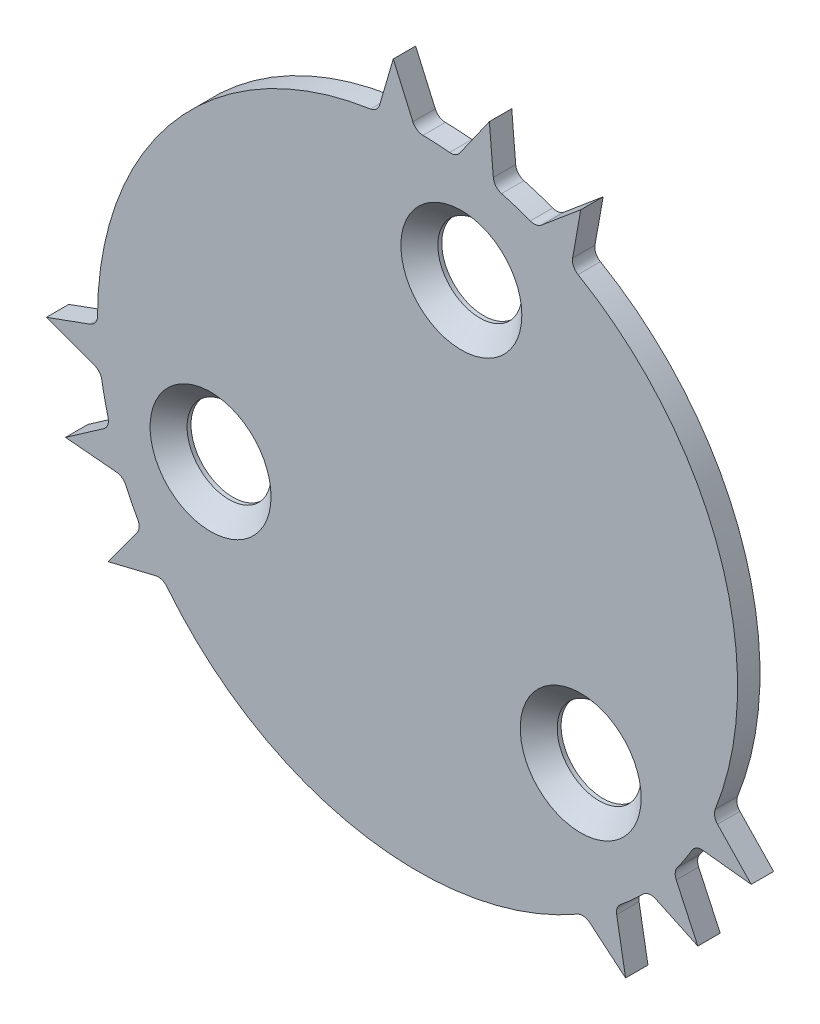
ISO-10303-21;
HEADER;
FILE_DESCRIPTION(('STEP AP214'),'2;1');
FILE_NAME('part.step','',(''),(''),'','','');
FILE_SCHEMA(('AUTOMOTIVE_DESIGN { 1 0 10303 214 1 1 1 1 }'));
ENDSEC;
DATA;
#1=APPLICATION_CONTEXT('core data for automotive mechanical design processes');
#2=APPLICATION_PROTOCOL_DEFINITION('international standard','automotive_design',2000,#1);
#3=PRODUCT_CONTEXT('',#1,'mechanical');
#4=PRODUCT('Part','Part','',(#3));
#5=PRODUCT_RELATED_PRODUCT_CATEGORY('part','',(#4));
#6=PRODUCT_DEFINITION_FORMATION('','',#4);
#7=PRODUCT_DEFINITION_CONTEXT('part definition',#1,'design');
#8=PRODUCT_DEFINITION('design','',#6,#7);
#9=PRODUCT_DEFINITION_SHAPE('','',#8);
#10=(LENGTH_UNIT() NAMED_UNIT(*) SI_UNIT(.MILLI.,.METRE.));
#11=(NAMED_UNIT(*) PLANE_ANGLE_UNIT() SI_UNIT($,.RADIAN.));
#12=(NAMED_UNIT(*) SI_UNIT($,.STERADIAN.) SOLID_ANGLE_UNIT());
#13=UNCERTAINTY_MEASURE_WITH_UNIT(LENGTH_MEASURE(1.E-05),#10,'distance_accuracy_value','');
#14=(GEOMETRIC_REPRESENTATION_CONTEXT(3) GLOBAL_UNCERTAINTY_ASSIGNED_CONTEXT((#13)) GLOBAL_UNIT_ASSIGNED_CONTEXT((#10,
#11,#12)) REPRESENTATION_CONTEXT('',''));
#15=CARTESIAN_POINT('',(0.,0.,0.));
#16=DIRECTION('',(0.,0.,1.));
#17=DIRECTION('',(1.,0.,0.));
#18=AXIS2_PLACEMENT_3D('',#15,#16,#17);
#19=CARTESIAN_POINT('',(0.,0.,2.));
#20=DIRECTION('',(0.,0.,-1.));
#21=DIRECTION('',(-1.,0.,0.));
#22=AXIS2_PLACEMENT_3D('',#19,#20,#21);
#23=CYLINDRICAL_SURFACE('',#22,28.5825681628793);
#24=CARTESIAN_POINT('',(0.,0.,0.));
#25=DIRECTION('',(0.,0.,1.));
#26=DIRECTION('',(1.,0.,0.));
#27=AXIS2_PLACEMENT_3D('',#24,#25,#26);
#28=CIRCLE('',#27,28.5825681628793);
#29=CARTESIAN_POINT('',(26.5846212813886,-10.4986243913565,0.));
#30=VERTEX_POINT('',#29);
#31=CARTESIAN_POINT('',(14.3320994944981,24.729620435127,0.));
#32=VERTEX_POINT('',#31);
#33=EDGE_CURVE('E393',#30,#32,#28,.T.);
#34=ORIENTED_EDGE('',*,*,#33,.T.);
#35=DIRECTION('',(0.,0.,-1.));
#36=VECTOR('',#35,1.);
#37=CARTESIAN_POINT('',(14.3320994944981,24.729620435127,2.));
#38=LINE('',#37,#36);
#39=CARTESIAN_POINT('',(14.3320994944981,24.729620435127,2.));
#40=VERTEX_POINT('',#39);
#41=EDGE_CURVE('E396',#32,#40,#38,.F.);
#42=ORIENTED_EDGE('',*,*,#41,.T.);
#43=CARTESIAN_POINT('',(0.,0.,2.));
#44=DIRECTION('',(0.,0.,1.));
#45=DIRECTION('',(1.,0.,0.));
#46=AXIS2_PLACEMENT_3D('',#43,#44,#45);
#47=CIRCLE('',#46,28.5825681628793);
#48=CARTESIAN_POINT('',(26.5846212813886,-10.4986243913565,2.));
#49=VERTEX_POINT('',#48);
#50=EDGE_CURVE('E388',#49,#40,#47,.T.);
#51=ORIENTED_EDGE('',*,*,#50,.F.);
#52=DIRECTION('',(0.,0.,-1.));
#53=VECTOR('',#52,1.);
#54=CARTESIAN_POINT('',(26.5846212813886,-10.4986243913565,2.));
#55=LINE('',#54,#53);
#56=EDGE_CURVE('E629',#49,#30,#55,.T.);
#57=ORIENTED_EDGE('',*,*,#56,.T.);
#58=EDGE_LOOP('',(#34,#42,#51,#57));
#59=FACE_BOUND('',#58,.T.);
#60=ADVANCED_FACE('F33',(#59),#23,.T.);
#61=CARTESIAN_POINT('',(23.1988255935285,-16.6966372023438,0.));
#62=VERTEX_POINT('',#61);
#63=CARTESIAN_POINT('',(24.5089127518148,-14.7063387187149,0.));
#64=VERTEX_POINT('',#63);
#65=EDGE_CURVE('E693',#62,#64,#28,.T.);
#66=ORIENTED_EDGE('',*,*,#65,.T.);
#67=DIRECTION('',(0.,0.,-1.));
#68=VECTOR('',#67,1.);
#69=CARTESIAN_POINT('',(24.5089127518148,-14.7063387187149,2.));
#70=LINE('',#69,#68);
#71=CARTESIAN_POINT('',(24.5089127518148,-14.7063387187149,2.));
#72=VERTEX_POINT('',#71);
#73=EDGE_CURVE('E641',#64,#72,#70,.F.);
#74=ORIENTED_EDGE('',*,*,#73,.T.);
#75=CARTESIAN_POINT('',(23.1988255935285,-16.6966372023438,2.));
#76=VERTEX_POINT('',#75);
#77=EDGE_CURVE('E697',#76,#72,#47,.T.);
#78=ORIENTED_EDGE('',*,*,#77,.F.);
#79=DIRECTION('',(0.,0.,-1.));
#80=VECTOR('',#79,1.);
#81=CARTESIAN_POINT('',(23.1988255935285,-16.6966372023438,2.));
#82=LINE('',#81,#80);
#83=EDGE_CURVE('E647',#76,#62,#82,.T.);
#84=ORIENTED_EDGE('',*,*,#83,.T.);
#85=EDGE_LOOP('',(#66,#74,#78,#84));
#86=FACE_BOUND('',#85,.T.);
#87=ADVANCED_FACE('F710',(#86),#23,.T.);
#88=CARTESIAN_POINT('',(18.1332385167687,-22.0940911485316,0.));
#89=VERTEX_POINT('',#88);
#90=CARTESIAN_POINT('',(20.1351261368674,-20.2864461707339,0.));
#91=VERTEX_POINT('',#90);
#92=EDGE_CURVE('E562',#89,#91,#28,.T.);
#93=ORIENTED_EDGE('',*,*,#92,.T.);
#94=DIRECTION('',(0.,0.,-1.));
#95=VECTOR('',#94,1.);
#96=CARTESIAN_POINT('',(20.1351261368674,-20.2864461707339,2.));
#97=LINE('',#96,#95);
#98=CARTESIAN_POINT('',(20.1351261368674,-20.2864461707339,2.));
#99=VERTEX_POINT('',#98);
#100=EDGE_CURVE('E659',#91,#99,#97,.F.);
#101=ORIENTED_EDGE('',*,*,#100,.T.);
#102=CARTESIAN_POINT('',(18.1332385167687,-22.0940911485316,2.));
#103=VERTEX_POINT('',#102);
#104=EDGE_CURVE('E679',#103,#99,#47,.T.);
#105=ORIENTED_EDGE('',*,*,#104,.F.);
#106=DIRECTION('',(0.,0.,-1.));
#107=VECTOR('',#106,1.);
#108=CARTESIAN_POINT('',(18.1332385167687,-22.0940911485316,2.));
#109=LINE('',#108,#107);
#110=EDGE_CURVE('E665',#103,#89,#109,.T.);
#111=ORIENTED_EDGE('',*,*,#110,.T.);
#112=EDGE_LOOP('',(#93,#101,#105,#111));
#113=FACE_BOUND('',#112,.T.);
#114=ADVANCED_FACE('F716',(#113),#23,.T.);
#115=CARTESIAN_POINT('',(14.7490004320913,-25.6436215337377,2.));
#116=DIRECTION('',(0.,0.,-1.));
#117=DIRECTION('',(0.499999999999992,0.866025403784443,0.));
#118=AXIS2_PLACEMENT_3D('',#115,#116,#117);
#119=CYLINDRICAL_SURFACE('',#118,1.);
#120=CARTESIAN_POINT('',(14.7490004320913,-25.6436215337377,0.));
#121=DIRECTION('',(0.,0.,1.));
#122=DIRECTION('',(-0.499999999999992,-0.866025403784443,0.));
#123=AXIS2_PLACEMENT_3D('',#120,#121,#122);
#124=CIRCLE('',#123,1.);
#125=CARTESIAN_POINT('',(15.3917880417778,-24.8775770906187,0.));
#126=VERTEX_POINT('',#125);
#127=CARTESIAN_POINT('',(14.250429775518,-24.7767724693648,0.));
#128=VERTEX_POINT('',#127);
#129=EDGE_CURVE('E671',#126,#128,#124,.T.);
#130=ORIENTED_EDGE('',*,*,#129,.F.);
#131=DIRECTION('',(0.,0.,-1.));
#132=VECTOR('',#131,1.);
#133=CARTESIAN_POINT('',(15.3917880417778,-24.8775770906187,-6.21875927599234));
#134=LINE('',#133,#132);
#135=CARTESIAN_POINT('',(15.3917880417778,-24.8775770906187,2.));
#136=VERTEX_POINT('',#135);
#137=EDGE_CURVE('E610',#136,#126,#134,.T.);
#138=ORIENTED_EDGE('',*,*,#137,.F.);
#139=CARTESIAN_POINT('',(14.7490004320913,-25.6436215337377,2.));
#140=DIRECTION('',(0.,0.,1.));
#141=DIRECTION('',(-0.499999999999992,-0.866025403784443,0.));
#142=AXIS2_PLACEMENT_3D('',#139,#140,#141);
#143=CIRCLE('',#142,1.);
#144=CARTESIAN_POINT('',(14.250429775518,-24.7767724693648,2.));
#145=VERTEX_POINT('',#144);
#146=EDGE_CURVE('E41',#145,#136,#143,.F.);
#147=ORIENTED_EDGE('',*,*,#146,.F.);
#148=DIRECTION('',(0.,0.,-1.));
#149=VECTOR('',#148,1.);
#150=CARTESIAN_POINT('',(14.250429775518,-24.7767724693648,2.));
#151=LINE('',#150,#149);
#152=EDGE_CURVE('E11',#128,#145,#151,.F.);
#153=ORIENTED_EDGE('',*,*,#152,.F.);
#154=EDGE_LOOP('',(#130,#138,#147,#153));
#155=FACE_BOUND('',#154,.T.);
#156=ADVANCED_FACE('F35',(#155),#119,.F.);
#157=CARTESIAN_POINT('',(18.7676545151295,-22.867082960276,2.));
#158=DIRECTION('',(0.,0.,-1.));
#159=DIRECTION('',(0.499999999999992,0.866025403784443,0.));
#160=AXIS2_PLACEMENT_3D('',#157,#158,#159);
#161=CYLINDRICAL_SURFACE('',#160,1.);
#162=CARTESIAN_POINT('',(18.7676545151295,-22.867082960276,0.));
#163=DIRECTION('',(0.,0.,1.));
#164=DIRECTION('',(-0.499999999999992,-0.866025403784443,0.));
#165=AXIS2_PLACEMENT_3D('',#162,#163,#164);
#166=CIRCLE('',#165,1.);
#167=CARTESIAN_POINT('',(17.7828467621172,-23.0407311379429,0.));
#168=VERTEX_POINT('',#167);
#169=EDGE_CURVE('E662',#89,#168,#166,.T.);
#170=ORIENTED_EDGE('',*,*,#169,.F.);
#171=ORIENTED_EDGE('',*,*,#110,.F.);
#172=CARTESIAN_POINT('',(18.7676545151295,-22.867082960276,2.));
#173=DIRECTION('',(0.,0.,1.));
#174=DIRECTION('',(-0.499999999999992,-0.866025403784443,0.));
#175=AXIS2_PLACEMENT_3D('',#172,#173,#174);
#176=CIRCLE('',#175,1.);
#177=CARTESIAN_POINT('',(17.7828467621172,-23.0407311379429,2.));
#178=VERTEX_POINT('',#177);
#179=EDGE_CURVE('E668',#178,#103,#176,.F.);
#180=ORIENTED_EDGE('',*,*,#179,.F.);
#181=DIRECTION('',(0.,0.,-1.));
#182=VECTOR('',#181,1.);
#183=CARTESIAN_POINT('',(17.7828467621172,-23.0407311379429,-6.21875927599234));
#184=LINE('',#183,#182);
#185=EDGE_CURVE('E621',#168,#178,#184,.F.);
#186=ORIENTED_EDGE('',*,*,#185,.F.);
#187=EDGE_LOOP('',(#170,#171,#180,#186));
#188=FACE_BOUND('',#187,.T.);
#189=ADVANCED_FACE('F783',(#188),#161,.F.);
#190=CARTESIAN_POINT('',(20.8395808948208,-20.9961950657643,2.));
#191=DIRECTION('',(0.,0.,-1.));
#192=DIRECTION('',(0.499999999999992,0.866025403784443,0.));
#193=AXIS2_PLACEMENT_3D('',#190,#191,#192);
#194=CYLINDRICAL_SURFACE('',#193,1.);
#195=CARTESIAN_POINT('',(20.8395808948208,-20.9961950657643,0.));
#196=DIRECTION('',(0.,0.,1.));
#197=DIRECTION('',(-0.499999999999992,-0.866025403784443,0.));
#198=AXIS2_PLACEMENT_3D('',#195,#196,#197);
#199=CIRCLE('',#198,1.);
#200=CARTESIAN_POINT('',(21.2640959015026,-20.0907741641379,0.));
#201=VERTEX_POINT('',#200);
#202=EDGE_CURVE('E653',#201,#91,#199,.T.);
#203=ORIENTED_EDGE('',*,*,#202,.F.);
#204=DIRECTION('',(0.,0.,-1.));
#205=VECTOR('',#204,1.);
#206=CARTESIAN_POINT('',(21.2640959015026,-20.0907741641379,-6.21875927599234));
#207=LINE('',#206,#205);
#208=CARTESIAN_POINT('',(21.2640959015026,-20.0907741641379,2.));
#209=VERTEX_POINT('',#208);
#210=EDGE_CURVE('E592',#209,#201,#207,.T.);
#211=ORIENTED_EDGE('',*,*,#210,.F.);
#212=CARTESIAN_POINT('',(20.8395808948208,-20.9961950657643,2.));
#213=DIRECTION('',(0.,0.,1.));
#214=DIRECTION('',(-0.499999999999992,-0.866025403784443,0.));
#215=AXIS2_PLACEMENT_3D('',#212,#213,#214);
#216=CIRCLE('',#215,1.);
#217=EDGE_CURVE('E656',#99,#209,#216,.F.);
#218=ORIENTED_EDGE('',*,*,#217,.F.);
#219=ORIENTED_EDGE('',*,*,#100,.F.);
#220=EDGE_LOOP('',(#203,#211,#218,#219));
#221=FACE_BOUND('',#220,.T.);
#222=ADVANCED_FACE('F778',(#221),#194,.F.);
#223=CARTESIAN_POINT('',(24.0104680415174,-17.2807917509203,2.));
#224=DIRECTION('',(0.,0.,-1.));
#225=DIRECTION('',(0.499999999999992,0.866025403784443,0.));
#226=AXIS2_PLACEMENT_3D('',#223,#224,#225);
#227=CYLINDRICAL_SURFACE('',#226,1.);
#228=CARTESIAN_POINT('',(24.0104680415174,-17.2807917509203,0.));
#229=DIRECTION('',(0.,0.,1.));
#230=DIRECTION('',(-0.499999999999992,-0.866025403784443,0.));
#231=AXIS2_PLACEMENT_3D('',#228,#229,#230);
#232=CIRCLE('',#231,1.);
#233=CARTESIAN_POINT('',(23.1032773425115,-17.7015114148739,0.));
#234=VERTEX_POINT('',#233);
#235=EDGE_CURVE('E644',#62,#234,#232,.T.);
#236=ORIENTED_EDGE('',*,*,#235,.F.);
#237=ORIENTED_EDGE('',*,*,#83,.F.);
#238=CARTESIAN_POINT('',(24.0104680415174,-17.2807917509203,2.));
#239=DIRECTION('',(0.,0.,1.));
#240=DIRECTION('',(-0.499999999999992,-0.866025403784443,0.));
#241=AXIS2_PLACEMENT_3D('',#238,#239,#240);
#242=CIRCLE('',#241,1.);
#243=CARTESIAN_POINT('',(23.1032773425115,-17.7015114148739,2.));
#244=VERTEX_POINT('',#243);
#245=EDGE_CURVE('E650',#244,#76,#242,.F.);
#246=ORIENTED_EDGE('',*,*,#245,.F.);
#247=DIRECTION('',(0.,0.,-1.));
#248=VECTOR('',#247,1.);
#249=CARTESIAN_POINT('',(23.1032773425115,-17.7015114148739,-6.21875927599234));
#250=LINE('',#249,#248);
#251=EDGE_CURVE('E603',#234,#244,#250,.F.);
#252=ORIENTED_EDGE('',*,*,#251,.F.);
#253=EDGE_LOOP('',(#236,#237,#246,#252));
#254=FACE_BOUND('',#253,.T.);
#255=ADVANCED_FACE('F767',(#254),#227,.F.);
#256=CARTESIAN_POINT('',(25.3663903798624,-15.2208599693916,2.));
#257=DIRECTION('',(0.,0.,-1.));
#258=DIRECTION('',(0.499999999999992,0.866025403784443,0.));
#259=AXIS2_PLACEMENT_3D('',#256,#257,#258);
#260=CYLINDRICAL_SURFACE('',#259,1.);
#261=CARTESIAN_POINT('',(25.3663903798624,-15.2208599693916,0.));
#262=DIRECTION('',(0.,0.,1.));
#263=DIRECTION('',(-0.499999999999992,-0.866025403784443,0.));
#264=AXIS2_PLACEMENT_3D('',#261,#262,#263);
#265=CIRCLE('',#264,1.);
#266=CARTESIAN_POINT('',(25.4753890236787,-14.2268180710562,0.));
#267=VERTEX_POINT('',#266);
#268=EDGE_CURVE('E635',#267,#64,#265,.T.);
#269=ORIENTED_EDGE('',*,*,#268,.F.);
#270=DIRECTION('',(0.,0.,-1.));
#271=VECTOR('',#270,1.);
#272=CARTESIAN_POINT('',(25.4753890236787,-14.2268180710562,-6.21875927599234));
#273=LINE('',#272,#271);
#274=CARTESIAN_POINT('',(25.4753890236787,-14.2268180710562,2.));
#275=VERTEX_POINT('',#274);
#276=EDGE_CURVE('E574',#275,#267,#273,.T.);
#277=ORIENTED_EDGE('',*,*,#276,.F.);
#278=CARTESIAN_POINT('',(25.3663903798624,-15.2208599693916,2.));
#279=DIRECTION('',(0.,0.,1.));
#280=DIRECTION('',(-0.499999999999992,-0.866025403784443,0.));
#281=AXIS2_PLACEMENT_3D('',#278,#279,#280);
#282=CIRCLE('',#281,1.);
#283=EDGE_CURVE('E638',#72,#275,#282,.F.);
#284=ORIENTED_EDGE('',*,*,#283,.F.);
#285=ORIENTED_EDGE('',*,*,#73,.F.);
#286=EDGE_LOOP('',(#269,#277,#284,#285));
#287=FACE_BOUND('',#286,.T.);
#288=ADVANCED_FACE('F762',(#287),#260,.F.);
#289=CARTESIAN_POINT('',(27.5147203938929,-10.8659330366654,2.));
#290=DIRECTION('',(0.,0.,-1.));
#291=DIRECTION('',(0.499999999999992,0.866025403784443,0.));
#292=AXIS2_PLACEMENT_3D('',#289,#290,#291);
#293=CYLINDRICAL_SURFACE('',#292,1.);
#294=CARTESIAN_POINT('',(27.5147203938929,-10.8659330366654,0.));
#295=DIRECTION('',(0.,0.,1.));
#296=DIRECTION('',(-0.499999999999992,-0.866025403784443,0.));
#297=AXIS2_PLACEMENT_3D('',#294,#295,#296);
#298=CIRCLE('',#297,1.);
#299=CARTESIAN_POINT('',(26.7922647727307,-11.5573503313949,0.));
#300=VERTEX_POINT('',#299);
#301=EDGE_CURVE('E626',#30,#300,#298,.T.);
#302=ORIENTED_EDGE('',*,*,#301,.F.);
#303=ORIENTED_EDGE('',*,*,#56,.F.);
#304=CARTESIAN_POINT('',(27.5147203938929,-10.8659330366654,2.));
#305=DIRECTION('',(0.,0.,1.));
#306=DIRECTION('',(-0.499999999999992,-0.866025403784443,0.));
#307=AXIS2_PLACEMENT_3D('',#304,#305,#306);
#308=CIRCLE('',#307,1.);
#309=CARTESIAN_POINT('',(26.7922647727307,-11.5573503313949,2.));
#310=VERTEX_POINT('',#309);
#311=EDGE_CURVE('E632',#310,#49,#308,.F.);
#312=ORIENTED_EDGE('',*,*,#311,.F.);
#313=DIRECTION('',(0.,0.,-1.));
#314=VECTOR('',#313,1.);
#315=CARTESIAN_POINT('',(26.7922647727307,-11.5573503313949,-6.21875927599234));
#316=LINE('',#315,#314);
#317=EDGE_CURVE('E585',#300,#310,#316,.F.);
#318=ORIENTED_EDGE('',*,*,#317,.F.);
#319=EDGE_LOOP('',(#302,#303,#312,#318));
#320=FACE_BOUND('',#319,.T.);
#321=ADVANCED_FACE('F751',(#320),#293,.F.);
#322=CARTESIAN_POINT('',(17.680149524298,-22.458306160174,-6.21875927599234));
#323=DIRECTION('',(0.984807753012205,0.173648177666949,0.));
#324=DIRECTION('',(-0.173648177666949,0.984807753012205,0.));
#325=AXIS2_PLACEMENT_3D('',#322,#323,#324);
#326=PLANE('',#325);
#327=DIRECTION('',(0.173648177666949,-0.984807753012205,0.));
#328=VECTOR('',#327,1.);
#329=CARTESIAN_POINT('',(17.680149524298,-22.458306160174,0.));
#330=LINE('',#329,#328);
#331=CARTESIAN_POINT('',(18.5781773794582,-27.5512752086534,0.));
#332=VERTEX_POINT('',#331);
#333=EDGE_CURVE('E618',#168,#332,#330,.T.);
#334=ORIENTED_EDGE('',*,*,#333,.F.);
#335=ORIENTED_EDGE('',*,*,#185,.T.);
#336=DIRECTION('',(-0.173648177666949,0.984807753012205,0.));
#337=VECTOR('',#336,1.);
#338=CARTESIAN_POINT('',(17.680149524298,-22.458306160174,2.));
#339=LINE('',#338,#337);
#340=CARTESIAN_POINT('',(18.5781773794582,-27.5512752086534,2.));
#341=VERTEX_POINT('',#340);
#342=EDGE_CURVE('E623',#341,#178,#339,.T.);
#343=ORIENTED_EDGE('',*,*,#342,.F.);
#344=DIRECTION('',(0.,0.,1.));
#345=VECTOR('',#344,1.);
#346=CARTESIAN_POINT('',(18.5781773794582,-27.5512752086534,-6.21875927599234));
#347=LINE('',#346,#345);
#348=EDGE_CURVE('E615',#332,#341,#347,.T.);
#349=ORIENTED_EDGE('',*,*,#348,.F.);
#350=EDGE_LOOP('',(#334,#335,#343,#349));
#351=FACE_BOUND('',#350,.T.);
#352=ADVANCED_FACE('F788',(#351),#326,.T.);
#353=CARTESIAN_POINT('',(18.5781773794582,-27.5512752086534,-6.21875927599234));
#354=DIRECTION('',(-0.642787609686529,-0.766044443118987,0.));
#355=DIRECTION('',(0.766044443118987,-0.642787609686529,0.));
#356=AXIS2_PLACEMENT_3D('',#353,#354,#355);
#357=PLANE('',#356);
#358=DIRECTION('',(0.766044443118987,-0.642787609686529,0.));
#359=VECTOR('',#358,1.);
#360=CARTESIAN_POINT('',(18.5781773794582,-27.5512752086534,2.));
#361=LINE('',#360,#359);
#362=EDGE_CURVE('E608',#136,#341,#361,.T.);
#363=ORIENTED_EDGE('',*,*,#362,.F.);
#364=ORIENTED_EDGE('',*,*,#137,.T.);
#365=DIRECTION('',(-0.766044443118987,0.642787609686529,0.));
#366=VECTOR('',#365,1.);
#367=CARTESIAN_POINT('',(18.5781773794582,-27.5512752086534,0.));
#368=LINE('',#367,#366);
#369=EDGE_CURVE('E612',#332,#126,#368,.T.);
#370=ORIENTED_EDGE('',*,*,#369,.F.);
#371=ORIENTED_EDGE('',*,*,#348,.T.);
#372=EDGE_LOOP('',(#363,#364,#370,#371));
#373=FACE_BOUND('',#372,.T.);
#374=ADVANCED_FACE('F790',(#373),#357,.T.);
#375=CARTESIAN_POINT('',(25.0302266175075,-21.85655956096,-6.21875927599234));
#376=DIRECTION('',(0.907190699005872,0.420719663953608,0.));
#377=DIRECTION('',(-0.420719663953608,0.907190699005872,0.));
#378=AXIS2_PLACEMENT_3D('',#375,#376,#377);
#379=PLANE('',#378);
#380=DIRECTION('',(0.420719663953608,-0.907190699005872,0.));
#381=VECTOR('',#380,1.);
#382=CARTESIAN_POINT('',(25.0302266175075,-21.85655956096,0.));
#383=LINE('',#382,#381);
#384=CARTESIAN_POINT('',(25.0302266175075,-21.85655956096,0.));
#385=VERTEX_POINT('',#384);
#386=EDGE_CURVE('E600',#234,#385,#383,.T.);
#387=ORIENTED_EDGE('',*,*,#386,.F.);
#388=ORIENTED_EDGE('',*,*,#251,.T.);
#389=DIRECTION('',(-0.420719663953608,0.907190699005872,0.));
#390=VECTOR('',#389,1.);
#391=CARTESIAN_POINT('',(25.0302266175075,-21.85655956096,2.));
#392=LINE('',#391,#390);
#393=CARTESIAN_POINT('',(25.0302266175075,-21.85655956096,2.));
#394=VERTEX_POINT('',#393);
#395=EDGE_CURVE('E605',#394,#244,#392,.T.);
#396=ORIENTED_EDGE('',*,*,#395,.F.);
#397=DIRECTION('',(0.,0.,1.));
#398=VECTOR('',#397,1.);
#399=CARTESIAN_POINT('',(25.0302266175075,-21.85655956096,-6.21875927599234));
#400=LINE('',#399,#398);
#401=EDGE_CURVE('E597',#385,#394,#400,.T.);
#402=ORIENTED_EDGE('',*,*,#401,.F.);
#403=EDGE_LOOP('',(#387,#388,#396,#402));
#404=FACE_BOUND('',#403,.T.);
#405=ADVANCED_FACE('F772',(#404),#379,.T.);
#406=CARTESIAN_POINT('',(25.0302266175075,-21.85655956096,-6.21875927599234));
#407=DIRECTION('',(-0.424515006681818,-0.905420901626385,0.));
#408=DIRECTION('',(0.905420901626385,-0.424515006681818,0.));
#409=AXIS2_PLACEMENT_3D('',#406,#407,#408);
#410=PLANE('',#409);
#411=DIRECTION('',(0.905420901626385,-0.424515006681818,0.));
#412=VECTOR('',#411,1.);
#413=CARTESIAN_POINT('',(25.0302266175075,-21.85655956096,2.));
#414=LINE('',#413,#412);
#415=EDGE_CURVE('E590',#209,#394,#414,.T.);
#416=ORIENTED_EDGE('',*,*,#415,.F.);
#417=ORIENTED_EDGE('',*,*,#210,.T.);
#418=DIRECTION('',(-0.905420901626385,0.424515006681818,0.));
#419=VECTOR('',#418,1.);
#420=CARTESIAN_POINT('',(25.0302266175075,-21.85655956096,0.));
#421=LINE('',#420,#419);
#422=EDGE_CURVE('E594',#385,#201,#421,.T.);
#423=ORIENTED_EDGE('',*,*,#422,.F.);
#424=ORIENTED_EDGE('',*,*,#401,.T.);
#425=EDGE_LOOP('',(#416,#417,#423,#424));
#426=FACE_BOUND('',#425,.T.);
#427=ADVANCED_FACE('F797',(#426),#410,.T.);
#428=CARTESIAN_POINT('',(29.8009780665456,-14.7011273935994,-6.21875927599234));
#429=DIRECTION('',(0.722455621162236,0.69141729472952,0.));
#430=DIRECTION('',(-0.69141729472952,0.722455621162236,0.));
#431=AXIS2_PLACEMENT_3D('',#428,#429,#430);
#432=PLANE('',#431);
#433=DIRECTION('',(0.69141729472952,-0.722455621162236,0.));
#434=VECTOR('',#433,1.);
#435=CARTESIAN_POINT('',(29.8009780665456,-14.7011273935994,0.));
#436=LINE('',#435,#434);
#437=CARTESIAN_POINT('',(29.8009780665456,-14.7011273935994,0.));
#438=VERTEX_POINT('',#437);
#439=EDGE_CURVE('E582',#300,#438,#436,.T.);
#440=ORIENTED_EDGE('',*,*,#439,.F.);
#441=ORIENTED_EDGE('',*,*,#317,.T.);
#442=DIRECTION('',(-0.69141729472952,0.722455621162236,0.));
#443=VECTOR('',#442,1.);
#444=CARTESIAN_POINT('',(29.8009780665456,-14.7011273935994,2.));
#445=LINE('',#444,#443);
#446=CARTESIAN_POINT('',(29.8009780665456,-14.7011273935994,2.));
#447=VERTEX_POINT('',#446);
#448=EDGE_CURVE('E587',#447,#310,#445,.T.);
#449=ORIENTED_EDGE('',*,*,#448,.F.);
#450=DIRECTION('',(0.,0.,1.));
#451=VECTOR('',#450,1.);
#452=CARTESIAN_POINT('',(29.8009780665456,-14.7011273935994,-6.21875927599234));
#453=LINE('',#452,#451);
#454=EDGE_CURVE('E579',#438,#447,#453,.T.);
#455=ORIENTED_EDGE('',*,*,#454,.F.);
#456=EDGE_LOOP('',(#440,#441,#449,#455));
#457=FACE_BOUND('',#456,.T.);
#458=ADVANCED_FACE('F754',(#457),#432,.T.);
#459=CARTESIAN_POINT('',(29.8009780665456,-14.7011273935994,-6.21875927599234));
#460=DIRECTION('',(-0.108998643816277,-0.994041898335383,0.));
#461=DIRECTION('',(0.994041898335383,-0.108998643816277,0.));
#462=AXIS2_PLACEMENT_3D('',#459,#460,#461);
#463=PLANE('',#462);
#464=DIRECTION('',(0.994041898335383,-0.108998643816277,0.));
#465=VECTOR('',#464,1.);
#466=CARTESIAN_POINT('',(29.8009780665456,-14.7011273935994,2.));
#467=LINE('',#466,#465);
#468=EDGE_CURVE('E572',#275,#447,#467,.T.);
#469=ORIENTED_EDGE('',*,*,#468,.F.);
#470=ORIENTED_EDGE('',*,*,#276,.T.);
#471=DIRECTION('',(-0.994041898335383,0.108998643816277,0.));
#472=VECTOR('',#471,1.);
#473=CARTESIAN_POINT('',(29.8009780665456,-14.7011273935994,0.));
#474=LINE('',#473,#472);
#475=EDGE_CURVE('E576',#438,#267,#474,.T.);
#476=ORIENTED_EDGE('',*,*,#475,.F.);
#477=ORIENTED_EDGE('',*,*,#454,.T.);
#478=EDGE_LOOP('',(#469,#470,#476,#477));
#479=FACE_BOUND('',#478,.T.);
#480=ADVANCED_FACE('F758',(#479),#463,.T.);
#481=CARTESIAN_POINT('',(14.5713546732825,-12.9305023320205,2.));
#482=DIRECTION('',(0.,0.,1.));
#483=DIRECTION('',(-0.499999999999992,-0.866025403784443,0.));
#484=AXIS2_PLACEMENT_3D('',#481,#482,#483);
#485=CYLINDRICAL_SURFACE('',#484,3.75);
#486=CARTESIAN_POINT('',(14.5713546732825,-12.9305023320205,0.));
#487=DIRECTION('',(0.,0.,1.));
#488=DIRECTION('',(-0.499999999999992,-0.866025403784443,0.));
#489=AXIS2_PLACEMENT_3D('',#486,#487,#488);
#490=CIRCLE('',#489,3.75);
#491=CARTESIAN_POINT('',(12.6963546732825,-16.1780975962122,0.));
#492=VERTEX_POINT('',#491);
#493=EDGE_CURVE('E569',#492,#492,#490,.T.);
#494=ORIENTED_EDGE('',*,*,#493,.F.);
#495=EDGE_LOOP('',(#494));
#496=FACE_BOUND('',#495,.T.);
#497=CARTESIAN_POINT('',(14.5713546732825,-12.9305023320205,0.35));
#498=DIRECTION('',(0.,0.,1.));
#499=DIRECTION('',(-0.499999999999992,-0.866025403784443,0.));
#500=AXIS2_PLACEMENT_3D('',#497,#498,#499);
#501=CIRCLE('',#500,3.75);
#502=CARTESIAN_POINT('',(12.6963546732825,-16.1780975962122,0.35));
#503=VERTEX_POINT('',#502);
#504=EDGE_CURVE('E563',#503,#503,#501,.T.);
#505=ORIENTED_EDGE('',*,*,#504,.T.);
#506=EDGE_LOOP('',(#505));
#507=FACE_BOUND('',#506,.T.);
#508=ADVANCED_FACE('F827',(#496,#507),#485,.F.);
#509=CARTESIAN_POINT('',(14.5713546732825,-12.9305023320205,2.));
#510=DIRECTION('',(0.,0.,1.));
#511=DIRECTION('',(-0.499999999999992,-0.866025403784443,0.));
#512=AXIS2_PLACEMENT_3D('',#509,#510,#511);
#513=CONICAL_SURFACE('',#512,5.4,0.785398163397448);
#514=ORIENTED_EDGE('',*,*,#504,.F.);
#515=EDGE_LOOP('',(#514));
#516=FACE_BOUND('',#515,.T.);
#517=CARTESIAN_POINT('',(14.5713546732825,-12.9305023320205,2.));
#518=DIRECTION('',(0.,0.,1.));
#519=DIRECTION('',(-0.499999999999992,-0.866025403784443,0.));
#520=AXIS2_PLACEMENT_3D('',#517,#518,#519);
#521=CIRCLE('',#520,5.4);
#522=CARTESIAN_POINT('',(11.8713546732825,-17.6070395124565,2.));
#523=VERTEX_POINT('',#522);
#524=EDGE_CURVE('E566',#523,#523,#521,.T.);
#525=ORIENTED_EDGE('',*,*,#524,.T.);
#526=EDGE_LOOP('',(#525));
#527=FACE_BOUND('',#526,.T.);
#528=ADVANCED_FACE('F820',(#516,#527),#513,.F.);
#529=CARTESIAN_POINT('',(-22.3843860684,-17.7736451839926,0.));
#530=VERTEX_POINT('',#529);
#531=EDGE_CURVE('E47',#530,#128,#28,.T.);
#532=ORIENTED_EDGE('',*,*,#531,.T.);
#533=ORIENTED_EDGE('',*,*,#152,.T.);
#534=CARTESIAN_POINT('',(-22.3843860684,-17.7736451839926,2.));
#535=VERTEX_POINT('',#534);
#536=EDGE_CURVE('E55',#535,#145,#47,.T.);
#537=ORIENTED_EDGE('',*,*,#536,.F.);
#538=DIRECTION('',(0.,0.,-1.));
#539=VECTOR('',#538,1.);
#540=CARTESIAN_POINT('',(-22.3843860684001,-17.7736451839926,2.));
#541=LINE('',#540,#539);
#542=EDGE_CURVE('E513',#535,#530,#541,.T.);
#543=ORIENTED_EDGE('',*,*,#542,.T.);
#544=EDGE_LOOP('',(#532,#533,#537,#543));
#545=FACE_BOUND('',#544,.T.);
#546=ADVANCED_FACE('F676',(#545),#23,.T.);
#547=CARTESIAN_POINT('',(-26.0591247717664,-11.7424537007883,0.));
#548=VERTEX_POINT('',#547);
#549=CARTESIAN_POINT('',(-24.9905193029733,-13.8721717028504,0.));
#550=VERTEX_POINT('',#549);
#551=EDGE_CURVE('E692',#548,#550,#28,.T.);
#552=ORIENTED_EDGE('',*,*,#551,.T.);
#553=DIRECTION('',(0.,0.,-1.));
#554=VECTOR('',#553,1.);
#555=CARTESIAN_POINT('',(-24.9905193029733,-13.8721717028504,2.));
#556=LINE('',#555,#554);
#557=CARTESIAN_POINT('',(-24.9905193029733,-13.8721717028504,2.));
#558=VERTEX_POINT('',#557);
#559=EDGE_CURVE('E523',#550,#558,#556,.F.);
#560=ORIENTED_EDGE('',*,*,#559,.T.);
#561=CARTESIAN_POINT('',(-26.0591247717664,-11.7424537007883,2.));
#562=VERTEX_POINT('',#561);
#563=EDGE_CURVE('E678',#562,#558,#47,.T.);
#564=ORIENTED_EDGE('',*,*,#563,.F.);
#565=DIRECTION('',(0.,0.,-1.));
#566=VECTOR('',#565,1.);
#567=CARTESIAN_POINT('',(-26.0591247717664,-11.7424537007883,2.));
#568=LINE('',#567,#566);
#569=EDGE_CURVE('E529',#562,#548,#568,.T.);
#570=ORIENTED_EDGE('',*,*,#569,.T.);
#571=EDGE_LOOP('',(#552,#560,#564,#570));
#572=FACE_BOUND('',#571,.T.);
#573=ADVANCED_FACE('F819',(#572),#23,.T.);
#574=CARTESIAN_POINT('',(-28.2006634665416,-4.65679963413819,0.));
#575=VERTEX_POINT('',#574);
#576=CARTESIAN_POINT('',(-27.6361408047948,-7.29430765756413,0.));
#577=VERTEX_POINT('',#576);
#578=EDGE_CURVE('E446',#575,#577,#28,.T.);
#579=ORIENTED_EDGE('',*,*,#578,.T.);
#580=DIRECTION('',(0.,0.,-1.));
#581=VECTOR('',#580,1.);
#582=CARTESIAN_POINT('',(-27.6361408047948,-7.29430765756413,2.));
#583=LINE('',#582,#581);
#584=CARTESIAN_POINT('',(-27.6361408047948,-7.29430765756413,2.));
#585=VERTEX_POINT('',#584);
#586=EDGE_CURVE('E541',#577,#585,#583,.F.);
#587=ORIENTED_EDGE('',*,*,#586,.T.);
#588=CARTESIAN_POINT('',(-28.2006634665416,-4.65679963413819,2.));
#589=VERTEX_POINT('',#588);
#590=EDGE_CURVE('E691',#589,#585,#47,.T.);
#591=ORIENTED_EDGE('',*,*,#590,.F.);
#592=DIRECTION('',(0.,0.,-1.));
#593=VECTOR('',#592,1.);
#594=CARTESIAN_POINT('',(-28.2006634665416,-4.65679963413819,2.));
#595=LINE('',#594,#593);
#596=EDGE_CURVE('E547',#589,#575,#595,.T.);
#597=ORIENTED_EDGE('',*,*,#596,.T.);
#598=EDGE_LOOP('',(#579,#587,#591,#597));
#599=FACE_BOUND('',#598,.T.);
#600=ADVANCED_FACE('F825',(#599),#23,.T.);
#601=CARTESIAN_POINT('',(-29.5825279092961,0.0488017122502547,2.));
#602=DIRECTION('',(0.,0.,-1.));
#603=DIRECTION('',(0.500000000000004,-0.866025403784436,0.));
#604=AXIS2_PLACEMENT_3D('',#601,#602,#603);
#605=CYLINDRICAL_SURFACE('',#604,1.);
#606=CARTESIAN_POINT('',(-29.5825279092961,0.0488017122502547,0.));
#607=DIRECTION('',(0.,0.,1.));
#608=DIRECTION('',(-0.500000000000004,0.866025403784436,0.));
#609=AXIS2_PLACEMENT_3D('',#606,#607,#608);
#610=CIRCLE('',#609,1.);
#611=CARTESIAN_POINT('',(-29.2405077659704,-0.89089090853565,0.));
#612=VERTEX_POINT('',#611);
#613=CARTESIAN_POINT('',(-28.5825292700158,0.0471520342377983,0.));
#614=VERTEX_POINT('',#613);
#615=EDGE_CURVE('E553',#612,#614,#610,.T.);
#616=ORIENTED_EDGE('',*,*,#615,.F.);
#617=DIRECTION('',(0.,0.,-1.));
#618=VECTOR('',#617,1.);
#619=CARTESIAN_POINT('',(-29.2405077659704,-0.89089090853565,-6.21875927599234));
#620=LINE('',#619,#618);
#621=CARTESIAN_POINT('',(-29.2405077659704,-0.89089090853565,2.));
#622=VERTEX_POINT('',#621);
#623=EDGE_CURVE('E494',#622,#612,#620,.T.);
#624=ORIENTED_EDGE('',*,*,#623,.F.);
#625=CARTESIAN_POINT('',(-29.5825279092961,0.0488017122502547,2.));
#626=DIRECTION('',(0.,0.,1.));
#627=DIRECTION('',(-0.500000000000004,0.866025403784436,0.));
#628=AXIS2_PLACEMENT_3D('',#625,#626,#627);
#629=CIRCLE('',#628,1.);
#630=CARTESIAN_POINT('',(-28.5825292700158,0.0471520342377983,2.));
#631=VERTEX_POINT('',#630);
#632=EDGE_CURVE('E556',#631,#622,#629,.F.);
#633=ORIENTED_EDGE('',*,*,#632,.F.);
#634=DIRECTION('',(0.,0.,-1.));
#635=VECTOR('',#634,1.);
#636=CARTESIAN_POINT('',(-28.5825292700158,0.0471520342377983,2.));
#637=LINE('',#636,#635);
#638=EDGE_CURVE('E559',#614,#631,#637,.F.);
#639=ORIENTED_EDGE('',*,*,#638,.F.);
#640=EDGE_LOOP('',(#616,#624,#633,#639));
#641=FACE_BOUND('',#640,.T.);
#642=ADVANCED_FACE('F838',(#641),#605,.F.);
#643=CARTESIAN_POINT('',(-29.18730201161,-4.81972409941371,2.));
#644=DIRECTION('',(0.,0.,-1.));
#645=DIRECTION('',(0.500000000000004,-0.866025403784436,0.));
#646=AXIS2_PLACEMENT_3D('',#643,#644,#645);
#647=CYLINDRICAL_SURFACE('',#646,1.);
#648=CARTESIAN_POINT('',(-29.18730201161,-4.81972409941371,0.));
#649=DIRECTION('',(0.,0.,1.));
#650=DIRECTION('',(-0.500000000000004,0.866025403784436,0.));
#651=AXIS2_PLACEMENT_3D('',#648,#649,#650);
#652=CIRCLE('',#651,1.);
#653=CARTESIAN_POINT('',(-28.8452818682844,-3.88003147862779,0.));
#654=VERTEX_POINT('',#653);
#655=EDGE_CURVE('E544',#575,#654,#652,.T.);
#656=ORIENTED_EDGE('',*,*,#655,.F.);
#657=ORIENTED_EDGE('',*,*,#596,.F.);
#658=CARTESIAN_POINT('',(-29.18730201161,-4.81972409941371,2.));
#659=DIRECTION('',(0.,0.,1.));
#660=DIRECTION('',(-0.500000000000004,0.866025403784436,0.));
#661=AXIS2_PLACEMENT_3D('',#658,#659,#660);
#662=CIRCLE('',#661,1.);
#663=CARTESIAN_POINT('',(-28.8452818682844,-3.88003147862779,2.));
#664=VERTEX_POINT('',#663);
#665=EDGE_CURVE('E550',#664,#589,#662,.F.);
#666=ORIENTED_EDGE('',*,*,#665,.F.);
#667=DIRECTION('',(0.,0.,-1.));
#668=VECTOR('',#667,1.);
#669=CARTESIAN_POINT('',(-28.8452818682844,-3.88003147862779,-6.21875927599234));
#670=LINE('',#669,#668);
#671=EDGE_CURVE('E505',#654,#664,#670,.F.);
#672=ORIENTED_EDGE('',*,*,#671,.F.);
#673=EDGE_LOOP('',(#656,#657,#666,#672));
#674=FACE_BOUND('',#673,.T.);
#675=ADVANCED_FACE('F894',(#674),#647,.F.);
#676=CARTESIAN_POINT('',(-28.6030287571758,-7.54950892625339,2.));
#677=DIRECTION('',(0.,0.,-1.));
#678=DIRECTION('',(0.500000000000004,-0.866025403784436,0.));
#679=AXIS2_PLACEMENT_3D('',#676,#677,#678);
#680=CYLINDRICAL_SURFACE('',#679,1.);
#681=CARTESIAN_POINT('',(-28.6030287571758,-7.54950892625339,0.));
#682=DIRECTION('',(0.,0.,1.));
#683=DIRECTION('',(-0.500000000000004,0.866025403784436,0.));
#684=AXIS2_PLACEMENT_3D('',#681,#682,#683);
#685=CIRCLE('',#684,1.);
#686=CARTESIAN_POINT('',(-28.0311687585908,-8.36986015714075,0.));
#687=VERTEX_POINT('',#686);
#688=EDGE_CURVE('E535',#687,#577,#685,.T.);
#689=ORIENTED_EDGE('',*,*,#688,.F.);
#690=DIRECTION('',(0.,0.,-1.));
#691=VECTOR('',#690,1.);
#692=CARTESIAN_POINT('',(-28.0311687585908,-8.36986015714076,-6.21875927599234));
#693=LINE('',#692,#691);
#694=CARTESIAN_POINT('',(-28.0311687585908,-8.36986015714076,2.));
#695=VERTEX_POINT('',#694);
#696=EDGE_CURVE('E476',#695,#687,#693,.T.);
#697=ORIENTED_EDGE('',*,*,#696,.F.);
#698=CARTESIAN_POINT('',(-28.6030287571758,-7.54950892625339,2.));
#699=DIRECTION('',(0.,0.,1.));
#700=DIRECTION('',(-0.500000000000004,0.866025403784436,0.));
#701=AXIS2_PLACEMENT_3D('',#698,#699,#700);
#702=CIRCLE('',#701,1.);
#703=EDGE_CURVE('E538',#585,#695,#702,.F.);
#704=ORIENTED_EDGE('',*,*,#703,.F.);
#705=ORIENTED_EDGE('',*,*,#586,.F.);
#706=EDGE_LOOP('',(#689,#697,#704,#705));
#707=FACE_BOUND('',#706,.T.);
#708=ADVANCED_FACE('F903',(#707),#680,.F.);
#709=CARTESIAN_POINT('',(-26.9708386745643,-12.1532794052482,2.));
#710=DIRECTION('',(0.,0.,-1.));
#711=DIRECTION('',(0.500000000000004,-0.866025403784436,0.));
#712=AXIS2_PLACEMENT_3D('',#709,#710,#711);
#713=CYLINDRICAL_SURFACE('',#712,1.);
#714=CARTESIAN_POINT('',(-26.9708386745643,-12.1532794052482,0.));
#715=DIRECTION('',(0.,0.,1.));
#716=DIRECTION('',(-0.500000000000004,0.866025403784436,0.));
#717=AXIS2_PLACEMENT_3D('',#714,#715,#716);
#718=CIRCLE('',#717,1.);
#719=CARTESIAN_POINT('',(-26.8815972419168,-11.1572693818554,0.));
#720=VERTEX_POINT('',#719);
#721=EDGE_CURVE('E526',#548,#720,#718,.T.);
#722=ORIENTED_EDGE('',*,*,#721,.F.);
#723=ORIENTED_EDGE('',*,*,#569,.F.);
#724=CARTESIAN_POINT('',(-26.9708386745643,-12.1532794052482,2.));
#725=DIRECTION('',(0.,0.,1.));
#726=DIRECTION('',(-0.500000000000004,0.866025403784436,0.));
#727=AXIS2_PLACEMENT_3D('',#724,#725,#726);
#728=CIRCLE('',#727,1.);
#729=CARTESIAN_POINT('',(-26.8815972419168,-11.1572693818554,2.));
#730=VERTEX_POINT('',#729);
#731=EDGE_CURVE('E532',#730,#562,#728,.F.);
#732=ORIENTED_EDGE('',*,*,#731,.F.);
#733=DIRECTION('',(0.,0.,-1.));
#734=VECTOR('',#733,1.);
#735=CARTESIAN_POINT('',(-26.8815972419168,-11.1572693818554,-6.21875927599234));
#736=LINE('',#735,#734);
#737=EDGE_CURVE('E487',#720,#730,#736,.F.);
#738=ORIENTED_EDGE('',*,*,#737,.F.);
#739=EDGE_LOOP('',(#722,#723,#732,#738));
#740=FACE_BOUND('',#739,.T.);
#741=ADVANCED_FACE('F912',(#740),#713,.F.);
#742=CARTESIAN_POINT('',(-25.86484659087,-14.3575084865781,2.));
#743=DIRECTION('',(0.,0.,-1.));
#744=DIRECTION('',(0.500000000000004,-0.866025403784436,0.));
#745=AXIS2_PLACEMENT_3D('',#742,#743,#744);
#746=CYLINDRICAL_SURFACE('',#745,1.);
#747=CARTESIAN_POINT('',(-25.86484659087,-14.3575084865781,0.));
#748=DIRECTION('',(0.,0.,1.));
#749=DIRECTION('',(-0.500000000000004,0.866025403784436,0.));
#750=AXIS2_PLACEMENT_3D('',#747,#748,#749);
#751=CIRCLE('',#750,1.);
#752=CARTESIAN_POINT('',(-25.0584803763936,-14.9489250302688,0.));
#753=VERTEX_POINT('',#752);
#754=EDGE_CURVE('E517',#753,#550,#751,.T.);
#755=ORIENTED_EDGE('',*,*,#754,.F.);
#756=DIRECTION('',(0.,0.,-1.));
#757=VECTOR('',#756,1.);
#758=CARTESIAN_POINT('',(-25.0584803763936,-14.9489250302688,-6.21875927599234));
#759=LINE('',#758,#757);
#760=CARTESIAN_POINT('',(-25.0584803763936,-14.9489250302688,2.));
#761=VERTEX_POINT('',#760);
#762=EDGE_CURVE('E458',#761,#753,#759,.T.);
#763=ORIENTED_EDGE('',*,*,#762,.F.);
#764=CARTESIAN_POINT('',(-25.86484659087,-14.3575084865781,2.));
#765=DIRECTION('',(0.,0.,1.));
#766=DIRECTION('',(-0.500000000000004,0.866025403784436,0.));
#767=AXIS2_PLACEMENT_3D('',#764,#765,#766);
#768=CIRCLE('',#767,1.);
#769=EDGE_CURVE('E520',#558,#761,#768,.F.);
#770=ORIENTED_EDGE('',*,*,#769,.F.);
#771=ORIENTED_EDGE('',*,*,#559,.F.);
#772=EDGE_LOOP('',(#755,#763,#770,#771));
#773=FACE_BOUND('',#772,.T.);
#774=ADVANCED_FACE('F922',(#773),#746,.F.);
#775=CARTESIAN_POINT('',(-23.1675342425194,-18.3954803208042,2.));
#776=DIRECTION('',(0.,0.,-1.));
#777=DIRECTION('',(0.500000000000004,-0.866025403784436,0.));
#778=AXIS2_PLACEMENT_3D('',#775,#776,#777);
#779=CYLINDRICAL_SURFACE('',#778,1.);
#780=CARTESIAN_POINT('',(-23.1675342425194,-18.3954803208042,0.));
#781=DIRECTION('',(0.,0.,1.));
#782=DIRECTION('',(-0.500000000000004,0.866025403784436,0.));
#783=AXIS2_PLACEMENT_3D('',#780,#781,#782);
#784=CIRCLE('',#783,1.);
#785=CARTESIAN_POINT('',(-23.4050913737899,-17.4241067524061,0.));
#786=VERTEX_POINT('',#785);
#787=EDGE_CURVE('E510',#530,#786,#784,.T.);
#788=ORIENTED_EDGE('',*,*,#787,.F.);
#789=ORIENTED_EDGE('',*,*,#542,.F.);
#790=CARTESIAN_POINT('',(-23.1675342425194,-18.3954803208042,2.));
#791=DIRECTION('',(0.,0.,1.));
#792=DIRECTION('',(-0.500000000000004,0.866025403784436,0.));
#793=AXIS2_PLACEMENT_3D('',#790,#791,#792);
#794=CIRCLE('',#793,1.);
#795=CARTESIAN_POINT('',(-23.4050913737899,-17.4241067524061,2.));
#796=VERTEX_POINT('',#795);
#797=EDGE_CURVE('E515',#796,#535,#794,.F.);
#798=ORIENTED_EDGE('',*,*,#797,.F.);
#799=DIRECTION('',(0.,0.,-1.));
#800=VECTOR('',#799,1.);
#801=CARTESIAN_POINT('',(-23.4050913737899,-17.4241067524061,-6.21875927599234));
#802=LINE('',#801,#800);
#803=EDGE_CURVE('E469',#786,#796,#802,.F.);
#804=ORIENTED_EDGE('',*,*,#803,.F.);
#805=EDGE_LOOP('',(#788,#789,#798,#804));
#806=FACE_BOUND('',#805,.T.);
#807=ADVANCED_FACE('F683',(#806),#779,.F.);
#808=CARTESIAN_POINT('',(-28.2895384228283,-4.08230555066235,-6.21875927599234));
#809=DIRECTION('',(-0.342020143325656,-0.939692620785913,0.));
#810=DIRECTION('',(0.939692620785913,-0.342020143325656,0.));
#811=AXIS2_PLACEMENT_3D('',#808,#809,#810);
#812=PLANE('',#811);
#813=DIRECTION('',(-0.939692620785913,0.342020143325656,0.));
#814=VECTOR('',#813,1.);
#815=CARTESIAN_POINT('',(-28.2895384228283,-4.08230555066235,0.));
#816=LINE('',#815,#814);
#817=CARTESIAN_POINT('',(-33.1491929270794,-2.31353596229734,0.));
#818=VERTEX_POINT('',#817);
#819=EDGE_CURVE('E502',#654,#818,#816,.T.);
#820=ORIENTED_EDGE('',*,*,#819,.F.);
#821=ORIENTED_EDGE('',*,*,#671,.T.);
#822=DIRECTION('',(0.939692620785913,-0.342020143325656,0.));
#823=VECTOR('',#822,1.);
#824=CARTESIAN_POINT('',(-28.2895384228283,-4.08230555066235,2.));
#825=LINE('',#824,#823);
#826=CARTESIAN_POINT('',(-33.1491929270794,-2.31353596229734,2.));
#827=VERTEX_POINT('',#826);
#828=EDGE_CURVE('E507',#827,#664,#825,.T.);
#829=ORIENTED_EDGE('',*,*,#828,.F.);
#830=DIRECTION('',(0.,0.,1.));
#831=VECTOR('',#830,1.);
#832=CARTESIAN_POINT('',(-33.1491929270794,-2.31353596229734,-6.21875927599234));
#833=LINE('',#832,#831);
#834=EDGE_CURVE('E499',#818,#827,#833,.T.);
#835=ORIENTED_EDGE('',*,*,#834,.F.);
#836=EDGE_LOOP('',(#820,#821,#829,#835));
#837=FACE_BOUND('',#836,.T.);
#838=ADVANCED_FACE('F941',(#837),#812,.T.);
#839=CARTESIAN_POINT('',(-33.1491929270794,-2.31353596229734,-6.21875927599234));
#840=DIRECTION('',(-0.342020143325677,0.939692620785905,0.));
#841=DIRECTION('',(-0.939692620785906,-0.342020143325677,0.));
#842=AXIS2_PLACEMENT_3D('',#839,#840,#841);
#843=PLANE('',#842);
#844=DIRECTION('',(-0.939692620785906,-0.342020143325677,0.));
#845=VECTOR('',#844,1.);
#846=CARTESIAN_POINT('',(-33.1491929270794,-2.31353596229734,2.));
#847=LINE('',#846,#845);
#848=EDGE_CURVE('E492',#622,#827,#847,.T.);
#849=ORIENTED_EDGE('',*,*,#848,.F.);
#850=ORIENTED_EDGE('',*,*,#623,.T.);
#851=DIRECTION('',(0.939692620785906,0.342020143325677,0.));
#852=VECTOR('',#851,1.);
#853=CARTESIAN_POINT('',(-33.1491929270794,-2.31353596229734,0.));
#854=LINE('',#853,#852);
#855=EDGE_CURVE('E496',#818,#612,#854,.T.);
#856=ORIENTED_EDGE('',*,*,#855,.F.);
#857=ORIENTED_EDGE('',*,*,#834,.T.);
#858=EDGE_LOOP('',(#849,#850,#856,#857));
#859=FACE_BOUND('',#858,.T.);
#860=ADVANCED_FACE('F950',(#859),#843,.T.);
#861=CARTESIAN_POINT('',(-31.4434491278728,-10.7485323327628,-6.21875927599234));
#862=DIRECTION('',(-0.0892414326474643,-0.996010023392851,0.));
#863=DIRECTION('',(0.996010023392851,-0.0892414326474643,0.));
#864=AXIS2_PLACEMENT_3D('',#861,#862,#863);
#865=PLANE('',#864);
#866=DIRECTION('',(-0.996010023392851,0.0892414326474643,0.));
#867=VECTOR('',#866,1.);
#868=CARTESIAN_POINT('',(-31.4434491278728,-10.7485323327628,0.));
#869=LINE('',#868,#867);
#870=CARTESIAN_POINT('',(-31.4434491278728,-10.7485323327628,0.));
#871=VERTEX_POINT('',#870);
#872=EDGE_CURVE('E484',#720,#871,#869,.T.);
#873=ORIENTED_EDGE('',*,*,#872,.F.);
#874=ORIENTED_EDGE('',*,*,#737,.T.);
#875=DIRECTION('',(0.996010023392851,-0.0892414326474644,0.));
#876=VECTOR('',#875,1.);
#877=CARTESIAN_POINT('',(-31.4434491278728,-10.7485323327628,2.));
#878=LINE('',#877,#876);
#879=CARTESIAN_POINT('',(-31.4434491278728,-10.7485323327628,2.));
#880=VERTEX_POINT('',#879);
#881=EDGE_CURVE('E489',#880,#730,#878,.T.);
#882=ORIENTED_EDGE('',*,*,#881,.F.);
#883=DIRECTION('',(0.,0.,1.));
#884=VECTOR('',#883,1.);
#885=CARTESIAN_POINT('',(-31.4434491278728,-10.7485323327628,-6.21875927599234));
#886=LINE('',#885,#884);
#887=EDGE_CURVE('E481',#871,#880,#886,.T.);
#888=ORIENTED_EDGE('',*,*,#887,.F.);
#889=EDGE_LOOP('',(#873,#874,#882,#888));
#890=FACE_BOUND('',#889,.T.);
#891=ADVANCED_FACE('F960',(#890),#865,.T.);
#892=CARTESIAN_POINT('',(-31.4434491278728,-10.7485323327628,-6.21875927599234));
#893=DIRECTION('',(-0.571859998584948,0.82035123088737,0.));
#894=DIRECTION('',(-0.820351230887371,-0.571859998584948,0.));
#895=AXIS2_PLACEMENT_3D('',#892,#893,#894);
#896=PLANE('',#895);
#897=DIRECTION('',(-0.820351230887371,-0.571859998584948,0.));
#898=VECTOR('',#897,1.);
#899=CARTESIAN_POINT('',(-31.4434491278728,-10.7485323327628,2.));
#900=LINE('',#899,#898);
#901=EDGE_CURVE('E474',#695,#880,#900,.T.);
#902=ORIENTED_EDGE('',*,*,#901,.F.);
#903=ORIENTED_EDGE('',*,*,#696,.T.);
#904=DIRECTION('',(0.820351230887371,0.571859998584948,0.));
#905=VECTOR('',#904,1.);
#906=CARTESIAN_POINT('',(-31.4434491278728,-10.7485323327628,0.));
#907=LINE('',#906,#905);
#908=EDGE_CURVE('E478',#871,#687,#907,.T.);
#909=ORIENTED_EDGE('',*,*,#908,.F.);
#910=ORIENTED_EDGE('',*,*,#887,.T.);
#911=EDGE_LOOP('',(#902,#903,#909,#910));
#912=FACE_BOUND('',#911,.T.);
#913=ADVANCED_FACE('F970',(#912),#896,.T.);
#914=CARTESIAN_POINT('',(-27.6320388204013,-18.4578403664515,-6.21875927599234));
#915=DIRECTION('',(0.237557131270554,-0.971373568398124,0.));
#916=DIRECTION('',(0.971373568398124,0.237557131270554,0.));
#917=AXIS2_PLACEMENT_3D('',#914,#915,#916);
#918=PLANE('',#917);
#919=DIRECTION('',(-0.971373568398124,-0.237557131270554,0.));
#920=VECTOR('',#919,1.);
#921=CARTESIAN_POINT('',(-27.6320388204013,-18.4578403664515,0.));
#922=LINE('',#921,#920);
#923=CARTESIAN_POINT('',(-27.6320388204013,-18.4578403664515,0.));
#924=VERTEX_POINT('',#923);
#925=EDGE_CURVE('E466',#786,#924,#922,.T.);
#926=ORIENTED_EDGE('',*,*,#925,.F.);
#927=ORIENTED_EDGE('',*,*,#803,.T.);
#928=DIRECTION('',(0.971373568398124,0.237557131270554,0.));
#929=VECTOR('',#928,1.);
#930=CARTESIAN_POINT('',(-27.6320388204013,-18.4578403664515,2.));
#931=LINE('',#930,#929);
#932=CARTESIAN_POINT('',(-27.6320388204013,-18.4578403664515,2.));
#933=VERTEX_POINT('',#932);
#934=EDGE_CURVE('E471',#933,#796,#931,.T.);
#935=ORIENTED_EDGE('',*,*,#934,.F.);
#936=DIRECTION('',(0.,0.,1.));
#937=VECTOR('',#936,1.);
#938=CARTESIAN_POINT('',(-27.6320388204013,-18.4578403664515,-6.21875927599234));
#939=LINE('',#938,#937);
#940=EDGE_CURVE('E463',#924,#933,#939,.T.);
#941=ORIENTED_EDGE('',*,*,#940,.F.);
#942=EDGE_LOOP('',(#926,#927,#935,#941));
#943=FACE_BOUND('',#942,.T.);
#944=ADVANCED_FACE('F688',(#943),#918,.T.);
#945=CARTESIAN_POINT('',(-27.6320388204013,-18.4578403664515,-6.21875927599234));
#946=DIRECTION('',(-0.806366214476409,0.591416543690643,0.));
#947=DIRECTION('',(-0.591416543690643,-0.806366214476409,0.));
#948=AXIS2_PLACEMENT_3D('',#945,#946,#947);
#949=PLANE('',#948);
#950=DIRECTION('',(-0.591416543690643,-0.806366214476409,0.));
#951=VECTOR('',#950,1.);
#952=CARTESIAN_POINT('',(-27.6320388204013,-18.4578403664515,2.));
#953=LINE('',#952,#951);
#954=EDGE_CURVE('E456',#761,#933,#953,.T.);
#955=ORIENTED_EDGE('',*,*,#954,.F.);
#956=ORIENTED_EDGE('',*,*,#762,.T.);
#957=DIRECTION('',(0.591416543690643,0.806366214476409,0.));
#958=VECTOR('',#957,1.);
#959=CARTESIAN_POINT('',(-27.6320388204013,-18.4578403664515,0.));
#960=LINE('',#959,#958);
#961=EDGE_CURVE('E460',#924,#753,#960,.T.);
#962=ORIENTED_EDGE('',*,*,#961,.F.);
#963=ORIENTED_EDGE('',*,*,#940,.T.);
#964=EDGE_LOOP('',(#955,#956,#962,#963));
#965=FACE_BOUND('',#964,.T.);
#966=ADVANCED_FACE('F989',(#965),#949,.T.);
#967=CARTESIAN_POINT('',(-18.483820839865,-6.15391214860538,2.));
#968=DIRECTION('',(0.,0.,1.));
#969=DIRECTION('',(-0.500000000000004,0.866025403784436,0.));
#970=AXIS2_PLACEMENT_3D('',#967,#968,#969);
#971=CYLINDRICAL_SURFACE('',#970,3.75);
#972=CARTESIAN_POINT('',(-18.483820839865,-6.15391214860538,0.));
#973=DIRECTION('',(0.,0.,1.));
#974=DIRECTION('',(-0.500000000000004,0.866025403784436,0.));
#975=AXIS2_PLACEMENT_3D('',#972,#973,#974);
#976=CIRCLE('',#975,3.75);
#977=CARTESIAN_POINT('',(-20.358820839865,-2.90631688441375,0.));
#978=VERTEX_POINT('',#977);
#979=EDGE_CURVE('E453',#978,#978,#976,.T.);
#980=ORIENTED_EDGE('',*,*,#979,.F.);
#981=EDGE_LOOP('',(#980));
#982=FACE_BOUND('',#981,.T.);
#983=CARTESIAN_POINT('',(-18.483820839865,-6.15391214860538,0.35));
#984=DIRECTION('',(0.,0.,1.));
#985=DIRECTION('',(-0.500000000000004,0.866025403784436,0.));
#986=AXIS2_PLACEMENT_3D('',#983,#984,#985);
#987=CIRCLE('',#986,3.75);
#988=CARTESIAN_POINT('',(-20.358820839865,-2.90631688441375,0.35));
#989=VERTEX_POINT('',#988);
#990=EDGE_CURVE('E447',#989,#989,#987,.T.);
#991=ORIENTED_EDGE('',*,*,#990,.T.);
#992=EDGE_LOOP('',(#991));
#993=FACE_BOUND('',#992,.T.);
#994=ADVANCED_FACE('F998',(#982,#993),#971,.F.);
#995=CARTESIAN_POINT('',(-18.483820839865,-6.15391214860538,2.));
#996=DIRECTION('',(0.,0.,1.));
#997=DIRECTION('',(-0.500000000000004,0.866025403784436,0.));
#998=AXIS2_PLACEMENT_3D('',#995,#996,#997);
#999=CONICAL_SURFACE('',#998,5.4,0.785398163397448);
#1000=ORIENTED_EDGE('',*,*,#990,.F.);
#1001=EDGE_LOOP('',(#1000));
#1002=FACE_BOUND('',#1001,.T.);
#1003=CARTESIAN_POINT('',(-18.483820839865,-6.15391214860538,2.));
#1004=DIRECTION('',(0.,0.,1.));
#1005=DIRECTION('',(-0.500000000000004,0.866025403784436,0.));
#1006=AXIS2_PLACEMENT_3D('',#1003,#1004,#1005);
#1007=CIRCLE('',#1006,5.4);
#1008=CARTESIAN_POINT('',(-21.183820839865,-1.47737496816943,2.));
#1009=VERTEX_POINT('',#1008);
#1010=EDGE_CURVE('E450',#1009,#1009,#1007,.T.);
#1011=ORIENTED_EDGE('',*,*,#1010,.T.);
#1012=EDGE_LOOP('',(#1011));
#1013=FACE_BOUND('',#1012,.T.);
#1014=ADVANCED_FACE('F1008',(#1002,#1013),#999,.F.);
#1015=CARTESIAN_POINT('',(-4.20023521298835,28.2722695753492,0.));
#1016=VERTEX_POINT('',#1015);
#1017=EDGE_CURVE('E383',#1016,#614,#28,.T.);
#1018=ORIENTED_EDGE('',*,*,#1017,.T.);
#1019=ORIENTED_EDGE('',*,*,#638,.T.);
#1020=CARTESIAN_POINT('',(-4.20023521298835,28.2722695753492,2.));
#1021=VERTEX_POINT('',#1020);
#1022=EDGE_CURVE('E387',#1021,#631,#47,.T.);
#1023=ORIENTED_EDGE('',*,*,#1022,.F.);
#1024=DIRECTION('',(0.,0.,-1.));
#1025=VECTOR('',#1024,1.);
#1026=CARTESIAN_POINT('',(-4.20023521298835,28.2722695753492,2.));
#1027=LINE('',#1026,#1025);
#1028=EDGE_CURVE('E394',#1021,#1016,#1027,.T.);
#1029=ORIENTED_EDGE('',*,*,#1028,.T.);
#1030=EDGE_LOOP('',(#1018,#1019,#1023,#1029));
#1031=FACE_BOUND('',#1030,.T.);
#1032=ADVANCED_FACE('F728',(#1031),#23,.T.);
#1033=CARTESIAN_POINT('',(2.86029917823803,28.4390909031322,2.));
#1034=VERTEX_POINT('',#1033);
#1035=CARTESIAN_POINT('',(0.48160655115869,28.5785104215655,2.));
#1036=VERTEX_POINT('',#1035);
#1037=EDGE_CURVE('E384',#1034,#1036,#47,.T.);
#1038=ORIENTED_EDGE('',*,*,#1037,.F.);
#1039=DIRECTION('',(0.,0.,-1.));
#1040=VECTOR('',#1039,1.);
#1041=CARTESIAN_POINT('',(2.86029917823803,28.4390909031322,2.));
#1042=LINE('',#1041,#1040);
#1043=CARTESIAN_POINT('',(2.86029917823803,28.4390909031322,0.));
#1044=VERTEX_POINT('',#1043);
#1045=EDGE_CURVE('E417',#1034,#1044,#1042,.T.);
#1046=ORIENTED_EDGE('',*,*,#1045,.T.);
#1047=CARTESIAN_POINT('',(0.48160655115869,28.5785104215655,0.));
#1048=VERTEX_POINT('',#1047);
#1049=EDGE_CURVE('E389',#1044,#1048,#28,.T.);
#1050=ORIENTED_EDGE('',*,*,#1049,.T.);
#1051=DIRECTION('',(0.,0.,-1.));
#1052=VECTOR('',#1051,1.);
#1053=CARTESIAN_POINT('',(0.48160655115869,28.5785104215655,2.));
#1054=LINE('',#1053,#1052);
#1055=EDGE_CURVE('E414',#1048,#1036,#1054,.F.);
#1056=ORIENTED_EDGE('',*,*,#1055,.T.);
#1057=EDGE_LOOP('',(#1038,#1046,#1050,#1056));
#1058=FACE_BOUND('',#1057,.T.);
#1059=ADVANCED_FACE('F720',(#1058),#23,.T.);
#1060=CARTESIAN_POINT('',(10.0674249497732,26.7508907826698,2.));
#1061=VERTEX_POINT('',#1060);
#1062=CARTESIAN_POINT('',(7.50101466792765,27.5807538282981,2.));
#1063=VERTEX_POINT('',#1062);
#1064=EDGE_CURVE('E386',#1061,#1063,#47,.T.);
#1065=ORIENTED_EDGE('',*,*,#1064,.F.);
#1066=DIRECTION('',(0.,0.,-1.));
#1067=VECTOR('',#1066,1.);
#1068=CARTESIAN_POINT('',(10.0674249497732,26.7508907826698,2.));
#1069=LINE('',#1068,#1067);
#1070=CARTESIAN_POINT('',(10.0674249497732,26.7508907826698,0.));
#1071=VERTEX_POINT('',#1070);
#1072=EDGE_CURVE('E407',#1061,#1071,#1069,.T.);
#1073=ORIENTED_EDGE('',*,*,#1072,.T.);
#1074=CARTESIAN_POINT('',(7.50101466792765,27.5807538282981,0.));
#1075=VERTEX_POINT('',#1074);
#1076=EDGE_CURVE('E392',#1071,#1075,#28,.T.);
#1077=ORIENTED_EDGE('',*,*,#1076,.T.);
#1078=DIRECTION('',(0.,0.,-1.));
#1079=VECTOR('',#1078,1.);
#1080=CARTESIAN_POINT('',(7.50101466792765,27.5807538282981,2.));
#1081=LINE('',#1080,#1079);
#1082=EDGE_CURVE('E404',#1075,#1063,#1081,.F.);
#1083=ORIENTED_EDGE('',*,*,#1082,.T.);
#1084=EDGE_LOOP('',(#1065,#1073,#1077,#1083));
#1085=FACE_BOUND('',#1084,.T.);
#1086=ADVANCED_FACE('F712',(#1085),#23,.T.);
#1087=CARTESIAN_POINT('',(0.,-63.0230713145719,2.));
#1088=DIRECTION('',(0.,0.,1.));
#1089=DIRECTION('',(1.,0.,0.));
#1090=AXIS2_PLACEMENT_3D('',#1087,#1088,#1089);
#1091=PLANE('',#1090);
#1092=ORIENTED_EDGE('',*,*,#524,.F.);
#1093=EDGE_LOOP('',(#1092));
#1094=FACE_BOUND('',#1093,.T.);
#1095=ORIENTED_EDGE('',*,*,#1010,.F.);
#1096=EDGE_LOOP('',(#1095));
#1097=FACE_BOUND('',#1096,.T.);
#1098=CARTESIAN_POINT('',(3.91246616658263,19.0844144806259,2.));
#1099=DIRECTION('',(0.,0.,1.));
#1100=DIRECTION('',(1.,0.,0.));
#1101=AXIS2_PLACEMENT_3D('',#1098,#1099,#1100);
#1102=CIRCLE('',#1101,5.4);
#1103=CARTESIAN_POINT('',(9.31246616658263,19.0844144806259,2.));
#1104=VERTEX_POINT('',#1103);
#1105=EDGE_CURVE('E368',#1104,#1104,#1102,.T.);
#1106=ORIENTED_EDGE('',*,*,#1105,.F.);
#1107=EDGE_LOOP('',(#1106));
#1108=FACE_BOUND('',#1107,.T.);
#1109=ORIENTED_EDGE('',*,*,#536,.T.);
#1110=ORIENTED_EDGE('',*,*,#146,.T.);
#1111=ORIENTED_EDGE('',*,*,#362,.T.);
#1112=ORIENTED_EDGE('',*,*,#342,.T.);
#1113=ORIENTED_EDGE('',*,*,#179,.T.);
#1114=ORIENTED_EDGE('',*,*,#104,.T.);
#1115=ORIENTED_EDGE('',*,*,#217,.T.);
#1116=ORIENTED_EDGE('',*,*,#415,.T.);
#1117=ORIENTED_EDGE('',*,*,#395,.T.);
#1118=ORIENTED_EDGE('',*,*,#245,.T.);
#1119=ORIENTED_EDGE('',*,*,#77,.T.);
#1120=ORIENTED_EDGE('',*,*,#283,.T.);
#1121=ORIENTED_EDGE('',*,*,#468,.T.);
#1122=ORIENTED_EDGE('',*,*,#448,.T.);
#1123=ORIENTED_EDGE('',*,*,#311,.T.);
#1124=ORIENTED_EDGE('',*,*,#50,.T.);
#1125=CARTESIAN_POINT('',(14.8335274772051,25.5948198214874,2.));
#1126=DIRECTION('',(0.,0.,1.));
#1127=DIRECTION('',(1.,0.,0.));
#1128=AXIS2_PLACEMENT_3D('',#1125,#1126,#1127);
#1129=CIRCLE('',#1128,1.);
#1130=CARTESIAN_POINT('',(13.8487197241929,25.7684679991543,2.));
#1131=VERTEX_POINT('',#1130);
#1132=EDGE_CURVE('E422',#40,#1131,#1129,.F.);
#1133=ORIENTED_EDGE('',*,*,#1132,.T.);
#1134=DIRECTION('',(0.173648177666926,0.984807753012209,0.));
#1135=VECTOR('',#1134,1.);
#1136=CARTESIAN_POINT('',(14.5710155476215,29.8648111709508,2.));
#1137=LINE('',#1136,#1135);
#1138=CARTESIAN_POINT('',(14.5710155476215,29.8648111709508,2.));
#1139=VERTEX_POINT('',#1138);
#1140=EDGE_CURVE('E371',#1131,#1139,#1137,.T.);
#1141=ORIENTED_EDGE('',*,*,#1140,.T.);
#1142=DIRECTION('',(-0.766044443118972,-0.642787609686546,0.));
#1143=VECTOR('',#1142,1.);
#1144=CARTESIAN_POINT('',(10.6093888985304,26.5406117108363,2.));
#1145=LINE('',#1144,#1143);
#1146=CARTESIAN_POINT('',(11.0624351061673,26.9207626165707,2.));
#1147=VERTEX_POINT('',#1146);
#1148=EDGE_CURVE('E354',#1139,#1147,#1145,.T.);
#1149=ORIENTED_EDGE('',*,*,#1148,.T.);
#1150=CARTESIAN_POINT('',(10.4196474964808,27.6868070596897,2.));
#1151=DIRECTION('',(0.,0.,1.));
#1152=DIRECTION('',(1.,0.,0.));
#1153=AXIS2_PLACEMENT_3D('',#1150,#1151,#1152);
#1154=CIRCLE('',#1153,1.);
#1155=EDGE_CURVE('E427',#1147,#1061,#1154,.F.);
#1156=ORIENTED_EDGE('',*,*,#1155,.T.);
#1157=ORIENTED_EDGE('',*,*,#1064,.T.);
#1158=CARTESIAN_POINT('',(7.7634478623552,28.5457039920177,2.));
#1159=DIRECTION('',(0.,0.,1.));
#1160=DIRECTION('',(1.,0.,0.));
#1161=AXIS2_PLACEMENT_3D('',#1158,#1159,#1160);
#1162=CIRCLE('',#1161,1.);
#1163=CARTESIAN_POINT('',(6.76707285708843,28.4606343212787,2.));
#1164=VERTEX_POINT('',#1163);
#1165=EDGE_CURVE('E431',#1063,#1164,#1162,.F.);
#1166=ORIENTED_EDGE('',*,*,#1165,.T.);
#1167=DIRECTION('',(-0.085069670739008,0.99637500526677,0.));
#1168=VECTOR('',#1167,1.);
#1169=CARTESIAN_POINT('',(6.41322251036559,32.6050918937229,2.));
#1170=LINE('',#1169,#1168);
#1171=CARTESIAN_POINT('',(6.41322251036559,32.6050918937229,2.));
#1172=VERTEX_POINT('',#1171);
#1173=EDGE_CURVE('E358',#1164,#1172,#1170,.T.);
#1174=ORIENTED_EDGE('',*,*,#1173,.T.);
#1175=DIRECTION('',(-0.575290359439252,-0.817949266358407,0.));
#1176=VECTOR('',#1175,1.);
#1177=CARTESIAN_POINT('',(6.41322251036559,32.6050918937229,2.));
#1178=LINE('',#1177,#1176);
#1179=CARTESIAN_POINT('',(3.77831989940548,28.8587807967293,2.));
#1180=VERTEX_POINT('',#1179);
#1181=EDGE_CURVE('E355',#1172,#1180,#1178,.T.);
#1182=ORIENTED_EDGE('',*,*,#1181,.T.);
#1183=CARTESIAN_POINT('',(2.96037063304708,29.4340711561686,2.));
#1184=DIRECTION('',(0.,0.,1.));
#1185=DIRECTION('',(1.,0.,0.));
#1186=AXIS2_PLACEMENT_3D('',#1183,#1184,#1185);
#1187=CIRCLE('',#1186,1.);
#1188=EDGE_CURVE('E435',#1180,#1034,#1187,.F.);
#1189=ORIENTED_EDGE('',*,*,#1188,.T.);
#1190=ORIENTED_EDGE('',*,*,#1037,.T.);
#1191=CARTESIAN_POINT('',(0.498456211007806,29.5783684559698,2.));
#1192=DIRECTION('',(0.,0.,1.));
#1193=DIRECTION('',(1.,0.,0.));
#1194=AXIS2_PLACEMENT_3D('',#1191,#1192,#1193);
#1195=CIRCLE('',#1194,1.);
#1196=CARTESIAN_POINT('',(-0.416908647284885,29.1757431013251,2.));
#1197=VERTEX_POINT('',#1196);
#1198=EDGE_CURVE('E326',#1036,#1197,#1195,.F.);
#1199=ORIENTED_EDGE('',*,*,#1198,.T.);
#1200=DIRECTION('',(-0.402625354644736,0.915364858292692,0.));
#1201=VECTOR('',#1200,1.);
#1202=CARTESIAN_POINT('',(-2.16893924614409,33.1589677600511,2.));
#1203=LINE('',#1202,#1201);
#1204=CARTESIAN_POINT('',(-2.16893924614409,33.1589677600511,2.));
#1205=VERTEX_POINT('',#1204);
#1206=EDGE_CURVE('E320',#1197,#1205,#1203,.T.);
#1207=ORIENTED_EDGE('',*,*,#1206,.T.);
#1208=DIRECTION('',(-0.279956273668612,-0.960012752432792,0.));
#1209=VECTOR('',#1208,1.);
#1210=CARTESIAN_POINT('',(-2.16893924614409,33.1589677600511,2.));
#1211=LINE('',#1210,#1209);
#1212=CARTESIAN_POINT('',(-3.38717339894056,28.9814570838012,2.));
#1213=VERTEX_POINT('',#1212);
#1214=EDGE_CURVE('E324',#1205,#1213,#1211,.T.);
#1215=ORIENTED_EDGE('',*,*,#1214,.T.);
#1216=CARTESIAN_POINT('',(-4.34718615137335,29.2614133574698,2.));
#1217=DIRECTION('',(0.,0.,1.));
#1218=DIRECTION('',(1.,0.,0.));
#1219=AXIS2_PLACEMENT_3D('',#1216,#1217,#1218);
#1220=CIRCLE('',#1219,1.);
#1221=EDGE_CURVE('E442',#1213,#1021,#1220,.F.);
#1222=ORIENTED_EDGE('',*,*,#1221,.T.);
#1223=ORIENTED_EDGE('',*,*,#1022,.T.);
#1224=ORIENTED_EDGE('',*,*,#632,.T.);
#1225=ORIENTED_EDGE('',*,*,#848,.T.);
#1226=ORIENTED_EDGE('',*,*,#828,.T.);
#1227=ORIENTED_EDGE('',*,*,#665,.T.);
#1228=ORIENTED_EDGE('',*,*,#590,.T.);
#1229=ORIENTED_EDGE('',*,*,#703,.T.);
#1230=ORIENTED_EDGE('',*,*,#901,.T.);
#1231=ORIENTED_EDGE('',*,*,#881,.T.);
#1232=ORIENTED_EDGE('',*,*,#731,.T.);
#1233=ORIENTED_EDGE('',*,*,#563,.T.);
#1234=ORIENTED_EDGE('',*,*,#769,.T.);
#1235=ORIENTED_EDGE('',*,*,#954,.T.);
#1236=ORIENTED_EDGE('',*,*,#934,.T.);
#1237=ORIENTED_EDGE('',*,*,#797,.T.);
#1238=EDGE_LOOP('',(#1109,#1110,#1111,#1112,#1113,#1114,#1115,#1116,#1117,#1118,#1119,#1120,
#1121,#1122,#1123,#1124,#1133,#1141,#1149,#1156,#1157,#1166,#1174,#1182,#1189,#1190,#1199,#1207,
#1215,#1222,#1223,#1224,#1225,#1226,#1227,#1228,#1229,#1230,#1231,#1232,#1233,#1234,#1235,#1236,#1237));
#1239=FACE_BOUND('',#1238,.T.);
#1240=ADVANCED_FACE('F322',(#1094,#1097,#1108,#1239),#1091,.T.);
#1241=CARTESIAN_POINT('',(0.,-63.0230713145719,0.));
#1242=DIRECTION('',(0.,0.,1.));
#1243=DIRECTION('',(1.,0.,0.));
#1244=AXIS2_PLACEMENT_3D('',#1241,#1242,#1243);
#1245=PLANE('',#1244);
#1246=ORIENTED_EDGE('',*,*,#493,.T.);
#1247=EDGE_LOOP('',(#1246));
#1248=FACE_BOUND('',#1247,.T.);
#1249=ORIENTED_EDGE('',*,*,#979,.T.);
#1250=EDGE_LOOP('',(#1249));
#1251=FACE_BOUND('',#1250,.T.);
#1252=CARTESIAN_POINT('',(3.91246616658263,19.0844144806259,0.));
#1253=DIRECTION('',(0.,0.,1.));
#1254=DIRECTION('',(1.,0.,0.));
#1255=AXIS2_PLACEMENT_3D('',#1252,#1253,#1254);
#1256=CIRCLE('',#1255,3.75);
#1257=CARTESIAN_POINT('',(7.66246616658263,19.0844144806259,0.));
#1258=VERTEX_POINT('',#1257);
#1259=EDGE_CURVE('E380',#1258,#1258,#1256,.T.);
#1260=ORIENTED_EDGE('',*,*,#1259,.T.);
#1261=EDGE_LOOP('',(#1260));
#1262=FACE_BOUND('',#1261,.T.);
#1263=ORIENTED_EDGE('',*,*,#531,.F.);
#1264=ORIENTED_EDGE('',*,*,#787,.T.);
#1265=ORIENTED_EDGE('',*,*,#925,.T.);
#1266=ORIENTED_EDGE('',*,*,#961,.T.);
#1267=ORIENTED_EDGE('',*,*,#754,.T.);
#1268=ORIENTED_EDGE('',*,*,#551,.F.);
#1269=ORIENTED_EDGE('',*,*,#721,.T.);
#1270=ORIENTED_EDGE('',*,*,#872,.T.);
#1271=ORIENTED_EDGE('',*,*,#908,.T.);
#1272=ORIENTED_EDGE('',*,*,#688,.T.);
#1273=ORIENTED_EDGE('',*,*,#578,.F.);
#1274=ORIENTED_EDGE('',*,*,#655,.T.);
#1275=ORIENTED_EDGE('',*,*,#819,.T.);
#1276=ORIENTED_EDGE('',*,*,#855,.T.);
#1277=ORIENTED_EDGE('',*,*,#615,.T.);
#1278=ORIENTED_EDGE('',*,*,#1017,.F.);
#1279=CARTESIAN_POINT('',(-4.34718615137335,29.2614133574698,0.));
#1280=DIRECTION('',(0.,0.,1.));
#1281=DIRECTION('',(1.,0.,0.));
#1282=AXIS2_PLACEMENT_3D('',#1279,#1280,#1281);
#1283=CIRCLE('',#1282,1.);
#1284=CARTESIAN_POINT('',(-3.38717339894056,28.9814570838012,0.));
#1285=VERTEX_POINT('',#1284);
#1286=EDGE_CURVE('E444',#1016,#1285,#1283,.T.);
#1287=ORIENTED_EDGE('',*,*,#1286,.T.);
#1288=DIRECTION('',(0.279956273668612,0.960012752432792,0.));
#1289=VECTOR('',#1288,1.);
#1290=CARTESIAN_POINT('',(-2.16893924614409,33.1589677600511,0.));
#1291=LINE('',#1290,#1289);
#1292=CARTESIAN_POINT('',(-2.16893924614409,33.1589677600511,0.));
#1293=VERTEX_POINT('',#1292);
#1294=EDGE_CURVE('E345',#1285,#1293,#1291,.T.);
#1295=ORIENTED_EDGE('',*,*,#1294,.T.);
#1296=DIRECTION('',(0.402625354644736,-0.915364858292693,0.));
#1297=VECTOR('',#1296,1.);
#1298=CARTESIAN_POINT('',(-2.16893924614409,33.1589677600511,0.));
#1299=LINE('',#1298,#1297);
#1300=CARTESIAN_POINT('',(-0.416908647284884,29.1757431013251,0.));
#1301=VERTEX_POINT('',#1300);
#1302=EDGE_CURVE('E335',#1293,#1301,#1299,.T.);
#1303=ORIENTED_EDGE('',*,*,#1302,.T.);
#1304=CARTESIAN_POINT('',(0.498456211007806,29.5783684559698,0.));
#1305=DIRECTION('',(0.,0.,1.));
#1306=DIRECTION('',(1.,0.,0.));
#1307=AXIS2_PLACEMENT_3D('',#1304,#1305,#1306);
#1308=CIRCLE('',#1307,1.);
#1309=EDGE_CURVE('E440',#1301,#1048,#1308,.T.);
#1310=ORIENTED_EDGE('',*,*,#1309,.T.);
#1311=ORIENTED_EDGE('',*,*,#1049,.F.);
#1312=CARTESIAN_POINT('',(2.96037063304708,29.4340711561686,0.));
#1313=DIRECTION('',(0.,0.,1.));
#1314=DIRECTION('',(1.,0.,0.));
#1315=AXIS2_PLACEMENT_3D('',#1312,#1313,#1314);
#1316=CIRCLE('',#1315,1.);
#1317=CARTESIAN_POINT('',(3.77831989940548,28.8587807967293,0.));
#1318=VERTEX_POINT('',#1317);
#1319=EDGE_CURVE('E437',#1044,#1318,#1316,.T.);
#1320=ORIENTED_EDGE('',*,*,#1319,.T.);
#1321=DIRECTION('',(0.575290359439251,0.817949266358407,0.));
#1322=VECTOR('',#1321,1.);
#1323=CARTESIAN_POINT('',(6.41322251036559,32.6050918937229,0.));
#1324=LINE('',#1323,#1322);
#1325=CARTESIAN_POINT('',(6.41322251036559,32.6050918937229,0.));
#1326=VERTEX_POINT('',#1325);
#1327=EDGE_CURVE('E351',#1318,#1326,#1324,.T.);
#1328=ORIENTED_EDGE('',*,*,#1327,.T.);
#1329=DIRECTION('',(0.085069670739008,-0.996375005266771,0.));
#1330=VECTOR('',#1329,1.);
#1331=CARTESIAN_POINT('',(6.41322251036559,32.6050918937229,0.));
#1332=LINE('',#1331,#1330);
#1333=CARTESIAN_POINT('',(6.76707285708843,28.4606343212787,0.));
#1334=VERTEX_POINT('',#1333);
#1335=EDGE_CURVE('E348',#1326,#1334,#1332,.T.);
#1336=ORIENTED_EDGE('',*,*,#1335,.T.);
#1337=CARTESIAN_POINT('',(7.7634478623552,28.5457039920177,0.));
#1338=DIRECTION('',(0.,0.,1.));
#1339=DIRECTION('',(1.,0.,0.));
#1340=AXIS2_PLACEMENT_3D('',#1337,#1338,#1339);
#1341=CIRCLE('',#1340,1.);
#1342=EDGE_CURVE('E433',#1334,#1075,#1341,.T.);
#1343=ORIENTED_EDGE('',*,*,#1342,.T.);
#1344=ORIENTED_EDGE('',*,*,#1076,.F.);
#1345=CARTESIAN_POINT('',(10.4196474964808,27.6868070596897,0.));
#1346=DIRECTION('',(0.,0.,1.));
#1347=DIRECTION('',(1.,0.,0.));
#1348=AXIS2_PLACEMENT_3D('',#1345,#1346,#1347);
#1349=CIRCLE('',#1348,1.);
#1350=CARTESIAN_POINT('',(11.0624351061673,26.9207626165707,0.));
#1351=VERTEX_POINT('',#1350);
#1352=EDGE_CURVE('E429',#1071,#1351,#1349,.T.);
#1353=ORIENTED_EDGE('',*,*,#1352,.T.);
#1354=DIRECTION('',(0.766044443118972,0.642787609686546,0.));
#1355=VECTOR('',#1354,1.);
#1356=CARTESIAN_POINT('',(10.6093888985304,26.5406117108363,0.));
#1357=LINE('',#1356,#1355);
#1358=CARTESIAN_POINT('',(14.5710155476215,29.8648111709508,0.));
#1359=VERTEX_POINT('',#1358);
#1360=EDGE_CURVE('E365',#1351,#1359,#1357,.T.);
#1361=ORIENTED_EDGE('',*,*,#1360,.T.);
#1362=DIRECTION('',(-0.173648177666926,-0.984807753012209,0.));
#1363=VECTOR('',#1362,1.);
#1364=CARTESIAN_POINT('',(14.5710155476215,29.8648111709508,0.));
#1365=LINE('',#1364,#1363);
#1366=CARTESIAN_POINT('',(13.8487197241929,25.7684679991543,0.));
#1367=VERTEX_POINT('',#1366);
#1368=EDGE_CURVE('E362',#1359,#1367,#1365,.T.);
#1369=ORIENTED_EDGE('',*,*,#1368,.T.);
#1370=CARTESIAN_POINT('',(14.8335274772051,25.5948198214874,0.));
#1371=DIRECTION('',(0.,0.,1.));
#1372=DIRECTION('',(1.,0.,0.));
#1373=AXIS2_PLACEMENT_3D('',#1370,#1371,#1372);
#1374=CIRCLE('',#1373,1.);
#1375=EDGE_CURVE('E424',#1367,#32,#1374,.T.);
#1376=ORIENTED_EDGE('',*,*,#1375,.T.);
#1377=ORIENTED_EDGE('',*,*,#33,.F.);
#1378=ORIENTED_EDGE('',*,*,#301,.T.);
#1379=ORIENTED_EDGE('',*,*,#439,.T.);
#1380=ORIENTED_EDGE('',*,*,#475,.T.);
#1381=ORIENTED_EDGE('',*,*,#268,.T.);
#1382=ORIENTED_EDGE('',*,*,#65,.F.);
#1383=ORIENTED_EDGE('',*,*,#235,.T.);
#1384=ORIENTED_EDGE('',*,*,#386,.T.);
#1385=ORIENTED_EDGE('',*,*,#422,.T.);
#1386=ORIENTED_EDGE('',*,*,#202,.T.);
#1387=ORIENTED_EDGE('',*,*,#92,.F.);
#1388=ORIENTED_EDGE('',*,*,#169,.T.);
#1389=ORIENTED_EDGE('',*,*,#333,.T.);
#1390=ORIENTED_EDGE('',*,*,#369,.T.);
#1391=ORIENTED_EDGE('',*,*,#129,.T.);
#1392=EDGE_LOOP('',(#1263,#1264,#1265,#1266,#1267,#1268,#1269,#1270,#1271,#1272,#1273,#1274,
#1275,#1276,#1277,#1278,#1287,#1295,#1303,#1310,#1311,#1320,#1328,#1336,#1343,#1344,#1353,#1361,
#1369,#1376,#1377,#1378,#1379,#1380,#1381,#1382,#1383,#1384,#1385,#1386,#1387,#1388,#1389,#1390,#1391));
#1393=FACE_BOUND('',#1392,.T.);
#1394=ADVANCED_FACE('F690',(#1248,#1251,#1262,#1393),#1245,.F.);
#1395=CARTESIAN_POINT('',(3.91246616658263,19.0844144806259,2.));
#1396=DIRECTION('',(0.,0.,1.));
#1397=DIRECTION('',(1.,0.,0.));
#1398=AXIS2_PLACEMENT_3D('',#1395,#1396,#1397);
#1399=CYLINDRICAL_SURFACE('',#1398,3.75);
#1400=ORIENTED_EDGE('',*,*,#1259,.F.);
#1401=EDGE_LOOP('',(#1400));
#1402=FACE_BOUND('',#1401,.T.);
#1403=CARTESIAN_POINT('',(3.91246616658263,19.0844144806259,0.35));
#1404=DIRECTION('',(0.,0.,1.));
#1405=DIRECTION('',(1.,0.,0.));
#1406=AXIS2_PLACEMENT_3D('',#1403,#1404,#1405);
#1407=CIRCLE('',#1406,3.75);
#1408=CARTESIAN_POINT('',(7.66246616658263,19.0844144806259,0.35));
#1409=VERTEX_POINT('',#1408);
#1410=EDGE_CURVE('E377',#1409,#1409,#1407,.T.);
#1411=ORIENTED_EDGE('',*,*,#1410,.T.);
#1412=EDGE_LOOP('',(#1411));
#1413=FACE_BOUND('',#1412,.T.);
#1414=ADVANCED_FACE('F1044',(#1402,#1413),#1399,.F.);
#1415=CARTESIAN_POINT('',(3.91246616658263,19.0844144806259,2.));
#1416=DIRECTION('',(0.,0.,1.));
#1417=DIRECTION('',(1.,0.,0.));
#1418=AXIS2_PLACEMENT_3D('',#1415,#1416,#1417);
#1419=CONICAL_SURFACE('',#1418,5.4,0.785398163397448);
#1420=ORIENTED_EDGE('',*,*,#1410,.F.);
#1421=EDGE_LOOP('',(#1420));
#1422=FACE_BOUND('',#1421,.T.);
#1423=ORIENTED_EDGE('',*,*,#1105,.T.);
#1424=EDGE_LOOP('',(#1423));
#1425=FACE_BOUND('',#1424,.T.);
#1426=ADVANCED_FACE('F1055',(#1422,#1425),#1419,.F.);
#1427=CARTESIAN_POINT('',(10.6093888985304,26.5406117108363,-6.21875927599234));
#1428=DIRECTION('',(-0.642787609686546,0.766044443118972,0.));
#1429=DIRECTION('',(-0.766044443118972,-0.642787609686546,0.));
#1430=AXIS2_PLACEMENT_3D('',#1427,#1428,#1429);
#1431=PLANE('',#1430);
#1432=ORIENTED_EDGE('',*,*,#1360,.F.);
#1433=DIRECTION('',(0.,0.,-1.));
#1434=VECTOR('',#1433,1.);
#1435=CARTESIAN_POINT('',(11.0624351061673,26.9207626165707,-6.21875927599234));
#1436=LINE('',#1435,#1434);
#1437=EDGE_CURVE('E401',#1351,#1147,#1436,.F.);
#1438=ORIENTED_EDGE('',*,*,#1437,.T.);
#1439=ORIENTED_EDGE('',*,*,#1148,.F.);
#1440=DIRECTION('',(0.,0.,1.));
#1441=VECTOR('',#1440,1.);
#1442=CARTESIAN_POINT('',(14.5710155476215,29.8648111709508,-6.21875927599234));
#1443=LINE('',#1442,#1441);
#1444=EDGE_CURVE('E366',#1359,#1139,#1443,.T.);
#1445=ORIENTED_EDGE('',*,*,#1444,.F.);
#1446=EDGE_LOOP('',(#1432,#1438,#1439,#1445));
#1447=FACE_BOUND('',#1446,.T.);
#1448=ADVANCED_FACE('F744',(#1447),#1431,.T.);
#1449=CARTESIAN_POINT('',(14.5710155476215,29.8648111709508,-6.21875927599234));
#1450=DIRECTION('',(0.984807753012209,-0.173648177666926,0.));
#1451=DIRECTION('',(0.173648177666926,0.984807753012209,0.));
#1452=AXIS2_PLACEMENT_3D('',#1449,#1450,#1451);
#1453=PLANE('',#1452);
#1454=ORIENTED_EDGE('',*,*,#1140,.F.);
#1455=DIRECTION('',(0.,0.,-1.));
#1456=VECTOR('',#1455,1.);
#1457=CARTESIAN_POINT('',(13.8487197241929,25.7684679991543,-6.21875927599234));
#1458=LINE('',#1457,#1456);
#1459=EDGE_CURVE('E399',#1131,#1367,#1458,.T.);
#1460=ORIENTED_EDGE('',*,*,#1459,.T.);
#1461=ORIENTED_EDGE('',*,*,#1368,.F.);
#1462=ORIENTED_EDGE('',*,*,#1444,.T.);
#1463=EDGE_LOOP('',(#1454,#1460,#1461,#1462));
#1464=FACE_BOUND('',#1463,.T.);
#1465=ADVANCED_FACE('F747',(#1464),#1453,.T.);
#1466=CARTESIAN_POINT('',(6.41322251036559,32.6050918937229,-6.21875927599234));
#1467=DIRECTION('',(-0.817949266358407,0.575290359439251,0.));
#1468=DIRECTION('',(-0.575290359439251,-0.817949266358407,0.));
#1469=AXIS2_PLACEMENT_3D('',#1466,#1467,#1468);
#1470=PLANE('',#1469);
#1471=ORIENTED_EDGE('',*,*,#1327,.F.);
#1472=DIRECTION('',(0.,0.,-1.));
#1473=VECTOR('',#1472,1.);
#1474=CARTESIAN_POINT('',(3.77831989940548,28.8587807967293,-6.21875927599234));
#1475=LINE('',#1474,#1473);
#1476=EDGE_CURVE('E411',#1318,#1180,#1475,.F.);
#1477=ORIENTED_EDGE('',*,*,#1476,.T.);
#1478=ORIENTED_EDGE('',*,*,#1181,.F.);
#1479=DIRECTION('',(0.,0.,1.));
#1480=VECTOR('',#1479,1.);
#1481=CARTESIAN_POINT('',(6.41322251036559,32.6050918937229,-6.21875927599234));
#1482=LINE('',#1481,#1480);
#1483=EDGE_CURVE('E352',#1326,#1172,#1482,.T.);
#1484=ORIENTED_EDGE('',*,*,#1483,.F.);
#1485=EDGE_LOOP('',(#1471,#1477,#1478,#1484));
#1486=FACE_BOUND('',#1485,.T.);
#1487=ADVANCED_FACE('F1076',(#1486),#1470,.T.);
#1488=CARTESIAN_POINT('',(6.41322251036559,32.6050918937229,-6.21875927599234));
#1489=DIRECTION('',(0.99637500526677,0.085069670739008,0.));
#1490=DIRECTION('',(-0.085069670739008,0.996375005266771,0.));
#1491=AXIS2_PLACEMENT_3D('',#1488,#1489,#1490);
#1492=PLANE('',#1491);
#1493=ORIENTED_EDGE('',*,*,#1173,.F.);
#1494=DIRECTION('',(0.,0.,-1.));
#1495=VECTOR('',#1494,1.);
#1496=CARTESIAN_POINT('',(6.76707285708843,28.4606343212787,-6.21875927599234));
#1497=LINE('',#1496,#1495);
#1498=EDGE_CURVE('E409',#1164,#1334,#1497,.T.);
#1499=ORIENTED_EDGE('',*,*,#1498,.T.);
#1500=ORIENTED_EDGE('',*,*,#1335,.F.);
#1501=ORIENTED_EDGE('',*,*,#1483,.T.);
#1502=EDGE_LOOP('',(#1493,#1499,#1500,#1501));
#1503=FACE_BOUND('',#1502,.T.);
#1504=ADVANCED_FACE('F1083',(#1503),#1492,.T.);
#1505=CARTESIAN_POINT('',(-2.16893924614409,33.1589677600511,-6.21875927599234));
#1506=DIRECTION('',(-0.960012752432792,0.279956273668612,0.));
#1507=DIRECTION('',(-0.279956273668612,-0.960012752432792,0.));
#1508=AXIS2_PLACEMENT_3D('',#1505,#1506,#1507);
#1509=PLANE('',#1508);
#1510=ORIENTED_EDGE('',*,*,#1294,.F.);
#1511=DIRECTION('',(0.,0.,-1.));
#1512=VECTOR('',#1511,1.);
#1513=CARTESIAN_POINT('',(-3.38717339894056,28.9814570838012,-6.21875927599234));
#1514=LINE('',#1513,#1512);
#1515=EDGE_CURVE('E342',#1285,#1213,#1514,.F.);
#1516=ORIENTED_EDGE('',*,*,#1515,.T.);
#1517=ORIENTED_EDGE('',*,*,#1214,.F.);
#1518=DIRECTION('',(0.,0.,1.));
#1519=VECTOR('',#1518,1.);
#1520=CARTESIAN_POINT('',(-2.16893924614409,33.1589677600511,-6.21875927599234));
#1521=LINE('',#1520,#1519);
#1522=EDGE_CURVE('E329',#1293,#1205,#1521,.T.);
#1523=ORIENTED_EDGE('',*,*,#1522,.F.);
#1524=EDGE_LOOP('',(#1510,#1516,#1517,#1523));
#1525=FACE_BOUND('',#1524,.T.);
#1526=ADVANCED_FACE('F340',(#1525),#1509,.T.);
#1527=CARTESIAN_POINT('',(-2.16893924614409,33.1589677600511,-6.21875927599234));
#1528=DIRECTION('',(0.915364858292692,0.402625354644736,0.));
#1529=DIRECTION('',(-0.402625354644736,0.915364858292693,0.));
#1530=AXIS2_PLACEMENT_3D('',#1527,#1528,#1529);
#1531=PLANE('',#1530);
#1532=ORIENTED_EDGE('',*,*,#1206,.F.);
#1533=DIRECTION('',(0.,0.,-1.));
#1534=VECTOR('',#1533,1.);
#1535=CARTESIAN_POINT('',(-0.416908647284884,29.1757431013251,-6.21875927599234));
#1536=LINE('',#1535,#1534);
#1537=EDGE_CURVE('E419',#1197,#1301,#1536,.T.);
#1538=ORIENTED_EDGE('',*,*,#1537,.T.);
#1539=ORIENTED_EDGE('',*,*,#1302,.F.);
#1540=ORIENTED_EDGE('',*,*,#1522,.T.);
#1541=EDGE_LOOP('',(#1532,#1538,#1539,#1540));
#1542=FACE_BOUND('',#1541,.T.);
#1543=ADVANCED_FACE('F333',(#1542),#1531,.T.);
#1544=CARTESIAN_POINT('',(14.8335274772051,25.5948198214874,2.));
#1545=DIRECTION('',(0.,0.,-1.));
#1546=DIRECTION('',(-1.,0.,0.));
#1547=AXIS2_PLACEMENT_3D('',#1544,#1545,#1546);
#1548=CYLINDRICAL_SURFACE('',#1547,1.);
#1549=ORIENTED_EDGE('',*,*,#1375,.F.);
#1550=ORIENTED_EDGE('',*,*,#1459,.F.);
#1551=ORIENTED_EDGE('',*,*,#1132,.F.);
#1552=ORIENTED_EDGE('',*,*,#41,.F.);
#1553=EDGE_LOOP('',(#1549,#1550,#1551,#1552));
#1554=FACE_BOUND('',#1553,.T.);
#1555=ADVANCED_FACE('F708',(#1554),#1548,.F.);
#1556=CARTESIAN_POINT('',(10.4196474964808,27.6868070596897,2.));
#1557=DIRECTION('',(0.,0.,-1.));
#1558=DIRECTION('',(-1.,0.,0.));
#1559=AXIS2_PLACEMENT_3D('',#1556,#1557,#1558);
#1560=CYLINDRICAL_SURFACE('',#1559,1.);
#1561=ORIENTED_EDGE('',*,*,#1352,.F.);
#1562=ORIENTED_EDGE('',*,*,#1072,.F.);
#1563=ORIENTED_EDGE('',*,*,#1155,.F.);
#1564=ORIENTED_EDGE('',*,*,#1437,.F.);
#1565=EDGE_LOOP('',(#1561,#1562,#1563,#1564));
#1566=FACE_BOUND('',#1565,.T.);
#1567=ADVANCED_FACE('F738',(#1566),#1560,.F.);
#1568=CARTESIAN_POINT('',(7.7634478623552,28.5457039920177,2.));
#1569=DIRECTION('',(0.,0.,-1.));
#1570=DIRECTION('',(-1.,0.,0.));
#1571=AXIS2_PLACEMENT_3D('',#1568,#1569,#1570);
#1572=CYLINDRICAL_SURFACE('',#1571,1.);
#1573=ORIENTED_EDGE('',*,*,#1342,.F.);
#1574=ORIENTED_EDGE('',*,*,#1498,.F.);
#1575=ORIENTED_EDGE('',*,*,#1165,.F.);
#1576=ORIENTED_EDGE('',*,*,#1082,.F.);
#1577=EDGE_LOOP('',(#1573,#1574,#1575,#1576));
#1578=FACE_BOUND('',#1577,.T.);
#1579=ADVANCED_FACE('F1115',(#1578),#1572,.F.);
#1580=CARTESIAN_POINT('',(2.96037063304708,29.4340711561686,2.));
#1581=DIRECTION('',(0.,0.,-1.));
#1582=DIRECTION('',(-1.,0.,0.));
#1583=AXIS2_PLACEMENT_3D('',#1580,#1581,#1582);
#1584=CYLINDRICAL_SURFACE('',#1583,1.);
#1585=ORIENTED_EDGE('',*,*,#1319,.F.);
#1586=ORIENTED_EDGE('',*,*,#1045,.F.);
#1587=ORIENTED_EDGE('',*,*,#1188,.F.);
#1588=ORIENTED_EDGE('',*,*,#1476,.F.);
#1589=EDGE_LOOP('',(#1585,#1586,#1587,#1588));
#1590=FACE_BOUND('',#1589,.T.);
#1591=ADVANCED_FACE('F1122',(#1590),#1584,.F.);
#1592=CARTESIAN_POINT('',(0.498456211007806,29.5783684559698,2.));
#1593=DIRECTION('',(0.,0.,-1.));
#1594=DIRECTION('',(-1.,0.,0.));
#1595=AXIS2_PLACEMENT_3D('',#1592,#1593,#1594);
#1596=CYLINDRICAL_SURFACE('',#1595,1.);
#1597=ORIENTED_EDGE('',*,*,#1309,.F.);
#1598=ORIENTED_EDGE('',*,*,#1537,.F.);
#1599=ORIENTED_EDGE('',*,*,#1198,.F.);
#1600=ORIENTED_EDGE('',*,*,#1055,.F.);
#1601=EDGE_LOOP('',(#1597,#1598,#1599,#1600));
#1602=FACE_BOUND('',#1601,.T.);
#1603=ADVANCED_FACE('F1130',(#1602),#1596,.F.);
#1604=CARTESIAN_POINT('',(-4.34718615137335,29.2614133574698,2.));
#1605=DIRECTION('',(0.,0.,-1.));
#1606=DIRECTION('',(-1.,0.,0.));
#1607=AXIS2_PLACEMENT_3D('',#1604,#1605,#1606);
#1608=CYLINDRICAL_SURFACE('',#1607,1.);
#1609=ORIENTED_EDGE('',*,*,#1286,.F.);
#1610=ORIENTED_EDGE('',*,*,#1028,.F.);
#1611=ORIENTED_EDGE('',*,*,#1221,.F.);
#1612=ORIENTED_EDGE('',*,*,#1515,.F.);
#1613=EDGE_LOOP('',(#1609,#1610,#1611,#1612));
#1614=FACE_BOUND('',#1613,.T.);
#1615=ADVANCED_FACE('F1138',(#1614),#1608,.F.);
#1616=CLOSED_SHELL('',(#60,#87,#114,#156,#189,#222,#255,#288,#321,#352,#374,#405,#427,#458,#480,
#508,#528,#546,#573,#600,#642,#675,#708,#741,#774,#807,#838,#860,#891,#913,#944,#966,#994,#1014,
#1032,#1059,#1086,#1240,#1394,#1414,#1426,#1448,#1465,#1487,#1504,#1526,#1543,#1555,#1567,#1579,
#1591,#1603,#1615));
#1617=MANIFOLD_SOLID_BREP('B2',#1616);
#1618=ADVANCED_BREP_SHAPE_REPRESENTATION('',(#18,#1617),#14);
#1619=SHAPE_DEFINITION_REPRESENTATION(#9,#1618);
ENDSEC;
END-ISO-10303-21;
